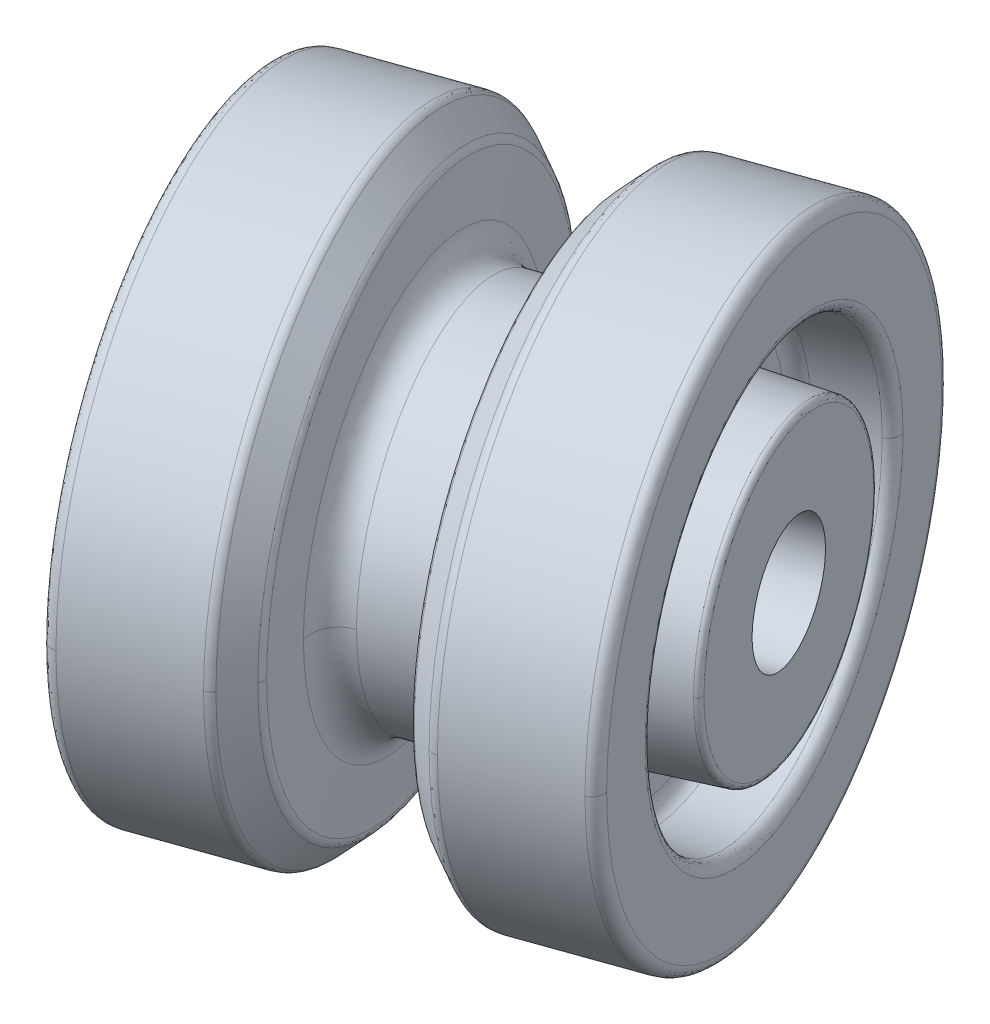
ISO-10303-21;
HEADER;
FILE_DESCRIPTION(('STEP AP214'),'2;1');
FILE_NAME('part.step','',(''),(''),'','','');
FILE_SCHEMA(('AUTOMOTIVE_DESIGN { 1 0 10303 214 1 1 1 1 }'));
ENDSEC;
DATA;
#1=APPLICATION_CONTEXT('core data for automotive mechanical design processes');
#2=APPLICATION_PROTOCOL_DEFINITION('international standard','automotive_design',2000,#1);
#3=PRODUCT_CONTEXT('',#1,'mechanical');
#4=PRODUCT('Part','Part','',(#3));
#5=PRODUCT_RELATED_PRODUCT_CATEGORY('part','',(#4));
#6=PRODUCT_DEFINITION_FORMATION('','',#4);
#7=PRODUCT_DEFINITION_CONTEXT('part definition',#1,'design');
#8=PRODUCT_DEFINITION('design','',#6,#7);
#9=PRODUCT_DEFINITION_SHAPE('','',#8);
#10=(LENGTH_UNIT() NAMED_UNIT(*) SI_UNIT(.MILLI.,.METRE.));
#11=(NAMED_UNIT(*) PLANE_ANGLE_UNIT() SI_UNIT($,.RADIAN.));
#12=(NAMED_UNIT(*) SI_UNIT($,.STERADIAN.) SOLID_ANGLE_UNIT());
#13=UNCERTAINTY_MEASURE_WITH_UNIT(LENGTH_MEASURE(1.E-05),#10,'distance_accuracy_value','');
#14=(GEOMETRIC_REPRESENTATION_CONTEXT(3) GLOBAL_UNCERTAINTY_ASSIGNED_CONTEXT((#13)) GLOBAL_UNIT_ASSIGNED_CONTEXT((#10,
#11,#12)) REPRESENTATION_CONTEXT('',''));
#15=CARTESIAN_POINT('',(0.,0.,0.));
#16=DIRECTION('',(0.,0.,1.));
#17=DIRECTION('',(1.,0.,0.));
#18=AXIS2_PLACEMENT_3D('',#15,#16,#17);
#19=CARTESIAN_POINT('',(6.07454196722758,-5.506360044,-28.4346009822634));
#20=DIRECTION('',(0.942641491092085,0.,-0.333806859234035));
#21=DIRECTION('',(-0.333806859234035,0.,-0.942641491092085));
#22=AXIS2_PLACEMENT_3D('',#19,#20,#21);
#23=CYLINDRICAL_SURFACE('',#22,1.05000000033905);
#24=CARTESIAN_POINT('',(13.6439531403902,-5.506360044,-31.115070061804));
#25=DIRECTION('',(0.942641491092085,0.,-0.333806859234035));
#26=DIRECTION('',(-0.333806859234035,0.,-0.942641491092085));
#27=AXIS2_PLACEMENT_3D('',#24,#25,#26);
#28=CIRCLE('',#27,1.05000000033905);
#29=CARTESIAN_POINT('',(13.2934559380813,-5.506360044,-32.1048436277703));
#30=VERTEX_POINT('',#29);
#31=EDGE_CURVE('E464',#30,#30,#28,.F.);
#32=ORIENTED_EDGE('',*,*,#31,.F.);
#33=EDGE_LOOP('',(#32));
#34=FACE_BOUND('',#33,.T.);
#35=CARTESIAN_POINT('',(10.7877494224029,-5.506360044,-30.1036352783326));
#36=DIRECTION('',(-0.942641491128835,0.,0.333806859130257));
#37=DIRECTION('',(0.333806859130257,0.,0.942641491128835));
#38=AXIS2_PLACEMENT_3D('',#35,#36,#37);
#39=CIRCLE('',#38,1.05000000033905);
#40=CARTESIAN_POINT('',(11.1382466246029,-5.506360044,-29.1138617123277));
#41=VERTEX_POINT('',#40);
#42=EDGE_CURVE('E308',#41,#41,#39,.T.);
#43=ORIENTED_EDGE('',*,*,#42,.T.);
#44=EDGE_LOOP('',(#43));
#45=FACE_BOUND('',#44,.T.);
#46=ADVANCED_FACE('F34',(#34,#45),#23,.F.);
#47=CARTESIAN_POINT('',(8.95316093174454,-5.506360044,-29.4539734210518));
#48=DIRECTION('',(-0.94264149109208,0.,0.333806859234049));
#49=DIRECTION('',(0.333806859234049,0.,0.94264149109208));
#50=AXIS2_PLACEMENT_3D('',#47,#48,#49);
#51=CONICAL_SURFACE('',#50,3.47383202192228,1.51843644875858);
#52=CARTESIAN_POINT('',(8.90625395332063,-5.506360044,-29.4373627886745));
#53=DIRECTION('',(-0.942641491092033,0.,0.333806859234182));
#54=DIRECTION('',(0.333806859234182,0.,0.942641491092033));
#55=AXIS2_PLACEMENT_3D('',#52,#53,#54);
#56=CIRCLE('',#55,4.42333240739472);
#57=CARTESIAN_POINT('',(7.42971525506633,-5.506360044,-33.60697944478));
#58=VERTEX_POINT('',#57);
#59=CARTESIAN_POINT('',(10.3827926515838,-5.50636004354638,-25.2677461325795));
#60=VERTEX_POINT('',#59);
#61=EDGE_CURVE('E251',#58,#60,#56,.T.);
#62=ORIENTED_EDGE('',*,*,#61,.F.);
#63=CARTESIAN_POINT('',(8.90625395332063,-5.506360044,-29.4373627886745));
#64=DIRECTION('',(-0.942641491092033,0.,0.333806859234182));
#65=DIRECTION('',(0.333806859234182,0.,0.942641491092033));
#66=AXIS2_PLACEMENT_3D('',#63,#64,#65);
#67=CIRCLE('',#66,4.42333240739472);
#68=EDGE_CURVE('E239',#60,#58,#67,.T.);
#69=ORIENTED_EDGE('',*,*,#68,.F.);
#70=EDGE_LOOP('',(#62,#69));
#71=FACE_BOUND('',#70,.T.);
#72=CARTESIAN_POINT('',(8.95316093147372,-5.506360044,-29.4539734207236));
#73=DIRECTION('',(-0.942641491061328,0.,0.333806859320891));
#74=DIRECTION('',(0.333806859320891,0.,0.942641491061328));
#75=AXIS2_PLACEMENT_3D('',#72,#73,#74);
#76=CIRCLE('',#75,3.47383202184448);
#77=CARTESIAN_POINT('',(7.79357197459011,-5.506360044,-32.7285516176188));
#78=VERTEX_POINT('',#77);
#79=CARTESIAN_POINT('',(10.1127498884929,-5.50636004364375,-26.1793952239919));
#80=VERTEX_POINT('',#79);
#81=EDGE_CURVE('E283',#78,#80,#76,.T.);
#82=ORIENTED_EDGE('',*,*,#81,.T.);
#83=CARTESIAN_POINT('',(8.95316093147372,-5.506360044,-29.4539734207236));
#84=DIRECTION('',(-0.942641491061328,0.,0.333806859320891));
#85=DIRECTION('',(0.333806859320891,0.,0.942641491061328));
#86=AXIS2_PLACEMENT_3D('',#83,#84,#85);
#87=CIRCLE('',#86,3.47383202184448);
#88=EDGE_CURVE('E294',#80,#78,#87,.T.);
#89=ORIENTED_EDGE('',*,*,#88,.T.);
#90=EDGE_LOOP('',(#82,#89));
#91=FACE_BOUND('',#90,.T.);
#92=ADVANCED_FACE('F252',(#71,#91),#51,.T.);
#93=CARTESIAN_POINT('',(7.776777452,-5.506360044,-32.775624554));
#94=CARTESIAN_POINT('',(7.776777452,1.54126206,-32.775624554));
#95=CARTESIAN_POINT('',(10.129322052,1.54126206,-26.132243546));
#96=CARTESIAN_POINT('',(10.129322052,-5.506360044,-26.132243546));
#97=CARTESIAN_POINT('',(7.871535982,-5.506360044,-32.461182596));
#98=CARTESIAN_POINT('',(7.871535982,0.885187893,-32.461182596));
#99=CARTESIAN_POINT('',(10.005078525,0.885187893,-26.436244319));
#100=CARTESIAN_POINT('',(10.005078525,-5.506360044,-26.436244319));
#101=CARTESIAN_POINT('',(8.171553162,-5.506360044,-32.327606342));
#102=CARTESIAN_POINT('',(8.171553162,0.433063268,-32.327606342));
#103=CARTESIAN_POINT('',(10.154173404,0.433063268,-26.728859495));
#104=CARTESIAN_POINT('',(10.154173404,-5.506360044,-26.728859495));
#105=CARTESIAN_POINT('',(8.468634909,-5.506360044,-32.467589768));
#106=CARTESIAN_POINT('',(8.468634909,0.498635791,-32.467589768));
#107=CARTESIAN_POINT('',(10.473143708,0.498635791,-26.807031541));
#108=CARTESIAN_POINT('',(10.473143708,-5.506360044,-26.807031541));
#109=(BOUNDED_SURFACE() B_SPLINE_SURFACE(3,3,((#93,#94,#95,#96),(#97,#98,#99,#100),(#101,#102,
#103,#104),(#105,#106,#107,#108)),.UNSPECIFIED.,.F.,.F.,.F.) B_SPLINE_SURFACE_WITH_KNOTS((4,4),
(4,4),(0.,1.),(0.,1.),
.UNSPECIFIED.) GEOMETRIC_REPRESENTATION_ITEM() RATIONAL_B_SPLINE_SURFACE(((1.,0.333333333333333,
0.333333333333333,1.),(0.768686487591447,0.256228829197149,0.256228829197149,0.768686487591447),
(0.768686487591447,0.256228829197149,0.256228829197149,0.768686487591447),(1.,0.333333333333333,
0.333333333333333,1.))) REPRESENTATION_ITEM('') SURFACE());
#110=CARTESIAN_POINT('',(9.42383574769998,-5.506360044,-29.6206481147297));
#111=DIRECTION('',(0.942641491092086,0.,-0.333806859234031));
#112=DIRECTION('',(-0.333806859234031,0.,-0.942641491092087));
#113=AXIS2_PLACEMENT_3D('',#110,#111,#112);
#114=CIRCLE('',#113,2.99999999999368);
#115=CARTESIAN_POINT('',(10.4252563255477,-5.50636004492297,-26.7927236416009));
#116=VERTEX_POINT('',#115);
#117=CARTESIAN_POINT('',(8.42241517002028,-5.50636004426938,-32.4485725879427));
#118=VERTEX_POINT('',#117);
#119=EDGE_CURVE('E269',#116,#118,#114,.F.);
#120=CARTESIAN_POINT('',(7.776777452,-5.506360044,-32.775624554));
#121=CARTESIAN_POINT('',(7.871535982,-5.506360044,-32.461182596));
#122=CARTESIAN_POINT('',(8.171553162,-5.506360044,-32.327606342));
#123=CARTESIAN_POINT('',(8.468634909,-5.506360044,-32.467589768));
#124=(BOUNDED_CURVE() B_SPLINE_CURVE(3,(#120,#121,#122,#123),.UNSPECIFIED.,.F.,
.F.) B_SPLINE_CURVE_WITH_KNOTS((4,4),(0.,1.),
.UNSPECIFIED.) CURVE() GEOMETRIC_REPRESENTATION_ITEM() RATIONAL_B_SPLINE_CURVE((1.,
0.768686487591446,0.768686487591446,1.)) REPRESENTATION_ITEM(''));
#125=EDGE_CURVE('E288',#118,#78,#124,.F.);
#126=CARTESIAN_POINT('',(10.129322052,-5.506360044,-26.132243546));
#127=CARTESIAN_POINT('',(10.005078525,-5.506360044,-26.436244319));
#128=CARTESIAN_POINT('',(10.154173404,-5.506360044,-26.728859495));
#129=CARTESIAN_POINT('',(10.473143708,-5.506360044,-26.807031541));
#130=(BOUNDED_CURVE() B_SPLINE_CURVE(3,(#126,#127,#128,#129),.UNSPECIFIED.,.F.,
.F.) B_SPLINE_CURVE_WITH_KNOTS((4,4),(0.,1.),
.UNSPECIFIED.) CURVE() GEOMETRIC_REPRESENTATION_ITEM() RATIONAL_B_SPLINE_CURVE((1.,
0.768686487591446,0.768686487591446,1.)) REPRESENTATION_ITEM(''));
#131=EDGE_CURVE('E249',#80,#116,#130,.T.);
#132=ORIENTED_EDGE('',*,*,#119,.T.);
#133=ORIENTED_EDGE('',*,*,#125,.T.);
#134=ORIENTED_EDGE('',*,*,#88,.F.);
#135=ORIENTED_EDGE('',*,*,#131,.T.);
#136=EDGE_LOOP('',(#132,#133,#134,#135));
#137=FACE_BOUND('',#136,.T.);
#138=ADVANCED_FACE('F494',(#137),#109,.F.);
#139=CARTESIAN_POINT('',(10.129322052,-5.506360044,-26.132243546));
#140=CARTESIAN_POINT('',(10.129322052,-12.553982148,-26.132243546));
#141=CARTESIAN_POINT('',(7.776777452,-12.553982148,-32.775624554));
#142=CARTESIAN_POINT('',(7.776777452,-5.506360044,-32.775624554));
#143=CARTESIAN_POINT('',(10.005078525,-5.506360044,-26.436244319));
#144=CARTESIAN_POINT('',(10.005078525,-11.897907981,-26.436244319));
#145=CARTESIAN_POINT('',(7.871535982,-11.897907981,-32.461182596));
#146=CARTESIAN_POINT('',(7.871535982,-5.506360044,-32.461182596));
#147=CARTESIAN_POINT('',(10.154173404,-5.506360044,-26.728859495));
#148=CARTESIAN_POINT('',(10.154173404,-11.445783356,-26.728859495));
#149=CARTESIAN_POINT('',(8.171553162,-11.445783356,-32.327606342));
#150=CARTESIAN_POINT('',(8.171553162,-5.506360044,-32.327606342));
#151=CARTESIAN_POINT('',(10.473143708,-5.506360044,-26.807031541));
#152=CARTESIAN_POINT('',(10.473143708,-11.511355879,-26.807031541));
#153=CARTESIAN_POINT('',(8.468634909,-11.511355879,-32.467589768));
#154=CARTESIAN_POINT('',(8.468634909,-5.506360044,-32.467589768));
#155=(BOUNDED_SURFACE() B_SPLINE_SURFACE(3,3,((#139,#140,#141,#142),(#143,#144,#145,#146),(#147,
#148,#149,#150),(#151,#152,#153,#154)),.UNSPECIFIED.,.F.,.F.,
.F.) B_SPLINE_SURFACE_WITH_KNOTS((4,4),(4,4),(0.,1.),(0.,1.),
.UNSPECIFIED.) GEOMETRIC_REPRESENTATION_ITEM() RATIONAL_B_SPLINE_SURFACE(((1.,0.333333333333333,
0.333333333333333,1.),(0.768686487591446,0.256228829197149,0.256228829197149,0.768686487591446),
(0.768686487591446,0.256228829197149,0.256228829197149,0.768686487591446),(1.,0.333333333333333,
0.333333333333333,1.))) REPRESENTATION_ITEM('') SURFACE());
#156=CARTESIAN_POINT('',(9.42383574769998,-5.506360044,-29.6206481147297));
#157=DIRECTION('',(0.942641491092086,0.,-0.333806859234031));
#158=DIRECTION('',(-0.333806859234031,0.,-0.942641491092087));
#159=AXIS2_PLACEMENT_3D('',#156,#157,#158);
#160=CIRCLE('',#159,2.99999999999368);
#161=EDGE_CURVE('E274',#118,#116,#160,.F.);
#162=ORIENTED_EDGE('',*,*,#131,.F.);
#163=ORIENTED_EDGE('',*,*,#81,.F.);
#164=ORIENTED_EDGE('',*,*,#125,.F.);
#165=ORIENTED_EDGE('',*,*,#161,.T.);
#166=EDGE_LOOP('',(#162,#163,#164,#165));
#167=FACE_BOUND('',#166,.T.);
#168=ADVANCED_FACE('F1165',(#167),#155,.F.);
#169=CARTESIAN_POINT('',(10.362048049,-5.506360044,-25.107249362));
#170=CARTESIAN_POINT('',(10.362048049,3.62903722,-25.107249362));
#171=CARTESIAN_POINT('',(7.312589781,3.62903722,-33.718653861));
#172=CARTESIAN_POINT('',(7.312589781,-5.506360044,-33.718653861));
#173=CARTESIAN_POINT('',(10.39552594,-5.506360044,-25.162463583));
#174=CARTESIAN_POINT('',(10.39552594,3.547293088,-25.162463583));
#175=CARTESIAN_POINT('',(7.373354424,3.547293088,-33.696812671));
#176=CARTESIAN_POINT('',(7.373354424,-5.506360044,-33.696812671));
#177=CARTESIAN_POINT('',(10.400592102,-5.506360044,-25.226835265));
#178=CARTESIAN_POINT('',(10.400592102,3.42931649,-25.226835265));
#179=CARTESIAN_POINT('',(7.417801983,3.42931649,-33.649974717));
#180=CARTESIAN_POINT('',(7.417801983,-5.506360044,-33.649974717));
#181=CARTESIAN_POINT('',(10.376163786,-5.506360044,-25.286606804));
#182=CARTESIAN_POINT('',(10.376163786,3.300321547,-25.286606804));
#183=CARTESIAN_POINT('',(7.436433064,3.300321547,-33.58815027));
#184=CARTESIAN_POINT('',(7.436433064,-5.506360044,-33.58815027));
#185=(BOUNDED_SURFACE() B_SPLINE_SURFACE(3,3,((#169,#170,#171,#172),(#173,#174,#175,#176),(#177,
#178,#179,#180),(#181,#182,#183,#184)),.UNSPECIFIED.,.F.,.F.,
.F.) B_SPLINE_SURFACE_WITH_KNOTS((4,4),(4,4),(0.,1.),(0.,1.),
.UNSPECIFIED.) GEOMETRIC_REPRESENTATION_ITEM() RATIONAL_B_SPLINE_SURFACE(((1.,0.333333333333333,
0.333333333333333,1.),(0.928759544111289,0.309586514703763,0.309586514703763,0.928759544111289),
(0.928759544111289,0.309586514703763,0.309586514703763,0.928759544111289),(1.,0.333333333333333,
0.333333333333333,1.))) REPRESENTATION_ITEM('') SURFACE());
#186=CARTESIAN_POINT('',(8.85129366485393,-5.506360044,-29.4179003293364));
#187=DIRECTION('',(-0.942641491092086,0.,0.333806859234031));
#188=DIRECTION('',(-0.33380685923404,0.,-0.942641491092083));
#189=AXIS2_PLACEMENT_3D('',#186,#187,#188);
#190=CIRCLE('',#189,4.55428657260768);
#191=CARTESIAN_POINT('',(7.33104156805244,-5.50636004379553,-33.7109598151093));
#192=VERTEX_POINT('',#191);
#193=CARTESIAN_POINT('',(10.3715457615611,-5.50636004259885,-25.1248408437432));
#194=VERTEX_POINT('',#193);
#195=EDGE_CURVE('E279',#192,#194,#190,.F.);
#196=CARTESIAN_POINT('',(10.362048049,-5.506360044,-25.107249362));
#197=CARTESIAN_POINT('',(10.39552594,-5.506360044,-25.162463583));
#198=CARTESIAN_POINT('',(10.400592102,-5.506360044,-25.226835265));
#199=CARTESIAN_POINT('',(10.376163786,-5.506360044,-25.286606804));
#200=(BOUNDED_CURVE() B_SPLINE_CURVE(3,(#196,#197,#198,#199),.UNSPECIFIED.,.F.,
.F.) B_SPLINE_CURVE_WITH_KNOTS((4,4),(0.,1.),
.UNSPECIFIED.) CURVE() GEOMETRIC_REPRESENTATION_ITEM() RATIONAL_B_SPLINE_CURVE((1.,
0.928759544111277,0.928759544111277,1.)) REPRESENTATION_ITEM(''));
#201=EDGE_CURVE('E246',#60,#194,#200,.F.);
#202=CARTESIAN_POINT('',(7.312589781,-5.506360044,-33.718653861));
#203=CARTESIAN_POINT('',(7.373354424,-5.506360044,-33.696812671));
#204=CARTESIAN_POINT('',(7.417801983,-5.506360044,-33.649974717));
#205=CARTESIAN_POINT('',(7.436433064,-5.506360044,-33.58815027));
#206=(BOUNDED_CURVE() B_SPLINE_CURVE(3,(#202,#203,#204,#205),.UNSPECIFIED.,.F.,
.F.) B_SPLINE_CURVE_WITH_KNOTS((4,4),(0.,1.),
.UNSPECIFIED.) CURVE() GEOMETRIC_REPRESENTATION_ITEM() RATIONAL_B_SPLINE_CURVE((1.,
0.928759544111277,0.928759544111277,1.)) REPRESENTATION_ITEM(''));
#207=EDGE_CURVE('E243',#192,#58,#206,.T.);
#208=ORIENTED_EDGE('',*,*,#195,.T.);
#209=ORIENTED_EDGE('',*,*,#201,.F.);
#210=ORIENTED_EDGE('',*,*,#68,.T.);
#211=ORIENTED_EDGE('',*,*,#207,.F.);
#212=EDGE_LOOP('',(#208,#209,#210,#211));
#213=FACE_BOUND('',#212,.T.);
#214=ADVANCED_FACE('F241',(#213),#185,.T.);
#215=CARTESIAN_POINT('',(7.312589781,-5.506360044,-33.718653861));
#216=CARTESIAN_POINT('',(7.312589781,-14.641757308,-33.718653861));
#217=CARTESIAN_POINT('',(10.362048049,-14.641757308,-25.107249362));
#218=CARTESIAN_POINT('',(10.362048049,-5.506360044,-25.107249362));
#219=CARTESIAN_POINT('',(7.373354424,-5.506360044,-33.696812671));
#220=CARTESIAN_POINT('',(7.373354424,-14.560013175,-33.696812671));
#221=CARTESIAN_POINT('',(10.39552594,-14.560013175,-25.162463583));
#222=CARTESIAN_POINT('',(10.39552594,-5.506360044,-25.162463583));
#223=CARTESIAN_POINT('',(7.417801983,-5.506360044,-33.649974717));
#224=CARTESIAN_POINT('',(7.417801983,-14.442036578,-33.649974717));
#225=CARTESIAN_POINT('',(10.400592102,-14.442036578,-25.226835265));
#226=CARTESIAN_POINT('',(10.400592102,-5.506360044,-25.226835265));
#227=CARTESIAN_POINT('',(7.436433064,-5.506360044,-33.58815027));
#228=CARTESIAN_POINT('',(7.436433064,-14.313041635,-33.58815027));
#229=CARTESIAN_POINT('',(10.376163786,-14.313041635,-25.286606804));
#230=CARTESIAN_POINT('',(10.376163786,-5.506360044,-25.286606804));
#231=(BOUNDED_SURFACE() B_SPLINE_SURFACE(3,3,((#215,#216,#217,#218),(#219,#220,#221,#222),(#223,
#224,#225,#226),(#227,#228,#229,#230)),.UNSPECIFIED.,.F.,.F.,
.F.) B_SPLINE_SURFACE_WITH_KNOTS((4,4),(4,4),(0.,1.),(0.,1.),
.UNSPECIFIED.) GEOMETRIC_REPRESENTATION_ITEM() RATIONAL_B_SPLINE_SURFACE(((1.,0.333333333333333,
0.333333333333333,1.),(0.928759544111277,0.309586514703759,0.309586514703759,0.928759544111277),
(0.928759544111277,0.309586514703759,0.309586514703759,0.928759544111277),(1.,0.333333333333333,
0.333333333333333,1.))) REPRESENTATION_ITEM('') SURFACE());
#232=CARTESIAN_POINT('',(8.85129366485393,-5.506360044,-29.4179003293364));
#233=DIRECTION('',(-0.942641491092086,0.,0.333806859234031));
#234=DIRECTION('',(-0.33380685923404,0.,-0.942641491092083));
#235=AXIS2_PLACEMENT_3D('',#232,#233,#234);
#236=CIRCLE('',#235,4.55428657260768);
#237=EDGE_CURVE('E259',#194,#192,#236,.F.);
#238=ORIENTED_EDGE('',*,*,#201,.T.);
#239=ORIENTED_EDGE('',*,*,#237,.T.);
#240=ORIENTED_EDGE('',*,*,#207,.T.);
#241=ORIENTED_EDGE('',*,*,#61,.T.);
#242=EDGE_LOOP('',(#238,#239,#240,#241));
#243=FACE_BOUND('',#242,.T.);
#244=ADVANCED_FACE('F257',(#243),#231,.T.);
#245=CARTESIAN_POINT('',(9.42383574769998,-5.506360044,-29.6206481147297));
#246=DIRECTION('',(0.942641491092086,0.,-0.333806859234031));
#247=DIRECTION('',(-0.333806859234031,0.,-0.942641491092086));
#248=AXIS2_PLACEMENT_3D('',#245,#246,#247);
#249=CYLINDRICAL_SURFACE('',#248,2.9999999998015);
#250=ORIENTED_EDGE('',*,*,#161,.F.);
#251=ORIENTED_EDGE('',*,*,#119,.F.);
#252=EDGE_LOOP('',(#250,#251));
#253=FACE_BOUND('',#252,.T.);
#254=CARTESIAN_POINT('',(10.2946593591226,-5.506360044,-29.9290229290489));
#255=DIRECTION('',(-0.942641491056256,0.,0.333806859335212));
#256=DIRECTION('',(0.333806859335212,0.,0.942641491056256));
#257=AXIS2_PLACEMENT_3D('',#254,#255,#256);
#258=CIRCLE('',#257,2.99999999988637);
#259=CARTESIAN_POINT('',(11.2960799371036,-5.50636004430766,-27.1010984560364));
#260=VERTEX_POINT('',#259);
#261=CARTESIAN_POINT('',(9.29323878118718,-5.50636004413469,-32.7569474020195));
#262=VERTEX_POINT('',#261);
#263=EDGE_CURVE('E1100',#260,#262,#258,.T.);
#264=ORIENTED_EDGE('',*,*,#263,.T.);
#265=CARTESIAN_POINT('',(10.2946593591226,-5.506360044,-29.9290229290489));
#266=DIRECTION('',(-0.942641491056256,0.,0.333806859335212));
#267=DIRECTION('',(0.333806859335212,0.,0.942641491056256));
#268=AXIS2_PLACEMENT_3D('',#265,#266,#267);
#269=CIRCLE('',#268,2.99999999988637);
#270=EDGE_CURVE('E1089',#262,#260,#269,.T.);
#271=ORIENTED_EDGE('',*,*,#270,.T.);
#272=EDGE_LOOP('',(#264,#271));
#273=FACE_BOUND('',#272,.T.);
#274=ADVANCED_FACE('F1135',(#253,#273),#249,.T.);
#275=CARTESIAN_POINT('',(8.85129366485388,-5.506360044,-29.4179003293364));
#276=DIRECTION('',(-0.942641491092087,0.,0.333806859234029));
#277=DIRECTION('',(0.333806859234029,0.,0.942641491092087));
#278=AXIS2_PLACEMENT_3D('',#275,#276,#277);
#279=CONICAL_SURFACE('',#278,4.55428657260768,0.78539816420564);
#280=CARTESIAN_POINT('',(8.48636435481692,-5.506360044,-29.2886720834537));
#281=DIRECTION('',(-0.942641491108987,0.,0.333806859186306));
#282=DIRECTION('',(0.333806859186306,0.,0.942641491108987));
#283=AXIS2_PLACEMENT_3D('',#280,#281,#282);
#284=CIRCLE('',#283,4.94142135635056);
#285=CARTESIAN_POINT('',(6.8368840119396,-5.506360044,-33.9466608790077));
#286=VERTEX_POINT('',#285);
#287=CARTESIAN_POINT('',(10.1358446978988,-5.50636004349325,-24.6306832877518));
#288=VERTEX_POINT('',#287);
#289=EDGE_CURVE('E1057',#286,#288,#284,.T.);
#290=ORIENTED_EDGE('',*,*,#289,.F.);
#291=CARTESIAN_POINT('',(8.48636435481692,-5.506360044,-29.2886720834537));
#292=DIRECTION('',(-0.942641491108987,0.,0.333806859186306));
#293=DIRECTION('',(0.333806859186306,0.,0.942641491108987));
#294=AXIS2_PLACEMENT_3D('',#291,#292,#293);
#295=CIRCLE('',#294,4.94142135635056);
#296=EDGE_CURVE('E1072',#288,#286,#295,.T.);
#297=ORIENTED_EDGE('',*,*,#296,.F.);
#298=EDGE_LOOP('',(#290,#297));
#299=FACE_BOUND('',#298,.T.);
#300=ORIENTED_EDGE('',*,*,#237,.F.);
#301=ORIENTED_EDGE('',*,*,#195,.F.);
#302=EDGE_LOOP('',(#300,#301));
#303=FACE_BOUND('',#302,.T.);
#304=ADVANCED_FACE('F1132',(#299,#303),#279,.T.);
#305=CARTESIAN_POINT('',(9.245351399,-5.506360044,-32.742639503));
#306=CARTESIAN_POINT('',(9.245351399,0.498635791,-32.742639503));
#307=CARTESIAN_POINT('',(11.249860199,0.498635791,-27.082081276));
#308=CARTESIAN_POINT('',(11.249860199,-5.506360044,-27.082081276));
#309=CARTESIAN_POINT('',(9.564321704,-5.506360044,-32.82081155));
#310=CARTESIAN_POINT('',(9.564321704,0.433063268,-32.82081155));
#311=CARTESIAN_POINT('',(11.546941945,0.433063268,-27.222064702));
#312=CARTESIAN_POINT('',(11.546941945,-5.506360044,-27.222064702));
#313=CARTESIAN_POINT('',(9.713416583,-5.506360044,-33.113426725));
#314=CARTESIAN_POINT('',(9.713416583,0.885187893,-33.113426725));
#315=CARTESIAN_POINT('',(11.846959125,0.885187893,-27.088488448));
#316=CARTESIAN_POINT('',(11.846959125,-5.506360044,-27.088488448));
#317=CARTESIAN_POINT('',(9.589173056,-5.506360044,-33.417427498));
#318=CARTESIAN_POINT('',(9.589173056,1.54126206,-33.417427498));
#319=CARTESIAN_POINT('',(11.941717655,1.54126206,-26.77404649));
#320=CARTESIAN_POINT('',(11.941717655,-5.506360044,-26.77404649));
#321=(BOUNDED_SURFACE() B_SPLINE_SURFACE(3,3,((#305,#306,#307,#308),(#309,#310,#311,#312),(#313,
#314,#315,#316),(#317,#318,#319,#320)),.UNSPECIFIED.,.F.,.F.,
.F.) B_SPLINE_SURFACE_WITH_KNOTS((4,4),(4,4),(0.,1.),(0.,1.),
.UNSPECIFIED.) GEOMETRIC_REPRESENTATION_ITEM() RATIONAL_B_SPLINE_SURFACE(((1.,0.333333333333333,
0.333333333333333,1.),(0.768686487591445,0.256228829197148,0.256228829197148,0.768686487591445),
(0.768686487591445,0.256228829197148,0.256228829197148,0.768686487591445),(1.,0.333333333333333,
0.333333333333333,1.))) REPRESENTATION_ITEM('') SURFACE());
#322=CARTESIAN_POINT('',(10.7653341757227,-5.506360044,-30.0956976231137));
#323=DIRECTION('',(0.942641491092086,0.,-0.333806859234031));
#324=DIRECTION('',(-0.333806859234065,0.,-0.942641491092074));
#325=AXIS2_PLACEMENT_3D('',#322,#323,#324);
#326=CIRCLE('',#325,3.4738320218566);
#327=CARTESIAN_POINT('',(11.924923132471,-5.50636004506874,-26.8211194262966));
#328=VERTEX_POINT('',#327);
#329=CARTESIAN_POINT('',(9.60574521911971,-5.50636004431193,-33.3702758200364));
#330=VERTEX_POINT('',#329);
#331=EDGE_CURVE('E1056',#328,#330,#326,.F.);
#332=CARTESIAN_POINT('',(9.245351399,-5.506360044,-32.742639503));
#333=CARTESIAN_POINT('',(9.564321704,-5.506360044,-32.82081155));
#334=CARTESIAN_POINT('',(9.713416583,-5.506360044,-33.113426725));
#335=CARTESIAN_POINT('',(9.589173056,-5.506360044,-33.417427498));
#336=(BOUNDED_CURVE() B_SPLINE_CURVE(3,(#332,#333,#334,#335),.UNSPECIFIED.,.F.,
.F.) B_SPLINE_CURVE_WITH_KNOTS((4,4),(0.,1.),
.UNSPECIFIED.) CURVE() GEOMETRIC_REPRESENTATION_ITEM() RATIONAL_B_SPLINE_CURVE((1.,
0.768686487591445,0.768686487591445,1.)) REPRESENTATION_ITEM(''));
#337=EDGE_CURVE('E1094',#330,#262,#336,.F.);
#338=CARTESIAN_POINT('',(11.249860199,-5.506360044,-27.082081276));
#339=CARTESIAN_POINT('',(11.546941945,-5.506360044,-27.222064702));
#340=CARTESIAN_POINT('',(11.846959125,-5.506360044,-27.088488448));
#341=CARTESIAN_POINT('',(11.941717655,-5.506360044,-26.77404649));
#342=(BOUNDED_CURVE() B_SPLINE_CURVE(3,(#338,#339,#340,#341),.UNSPECIFIED.,.F.,
.F.) B_SPLINE_CURVE_WITH_KNOTS((4,4),(0.,1.),
.UNSPECIFIED.) CURVE() GEOMETRIC_REPRESENTATION_ITEM() RATIONAL_B_SPLINE_CURVE((1.,
0.768686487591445,0.768686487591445,1.)) REPRESENTATION_ITEM(''));
#343=EDGE_CURVE('E1087',#260,#328,#342,.T.);
#344=ORIENTED_EDGE('',*,*,#331,.T.);
#345=ORIENTED_EDGE('',*,*,#337,.T.);
#346=ORIENTED_EDGE('',*,*,#263,.F.);
#347=ORIENTED_EDGE('',*,*,#343,.T.);
#348=EDGE_LOOP('',(#344,#345,#346,#347));
#349=FACE_BOUND('',#348,.T.);
#350=ADVANCED_FACE('F1134',(#349),#321,.F.);
#351=CARTESIAN_POINT('',(11.249860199,-5.506360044,-27.082081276));
#352=CARTESIAN_POINT('',(11.249860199,-11.511355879,-27.082081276));
#353=CARTESIAN_POINT('',(9.245351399,-11.511355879,-32.742639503));
#354=CARTESIAN_POINT('',(9.245351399,-5.506360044,-32.742639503));
#355=CARTESIAN_POINT('',(11.546941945,-5.506360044,-27.222064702));
#356=CARTESIAN_POINT('',(11.546941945,-11.445783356,-27.222064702));
#357=CARTESIAN_POINT('',(9.564321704,-11.445783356,-32.82081155));
#358=CARTESIAN_POINT('',(9.564321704,-5.506360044,-32.82081155));
#359=CARTESIAN_POINT('',(11.846959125,-5.506360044,-27.088488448));
#360=CARTESIAN_POINT('',(11.846959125,-11.897907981,-27.088488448));
#361=CARTESIAN_POINT('',(9.713416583,-11.897907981,-33.113426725));
#362=CARTESIAN_POINT('',(9.713416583,-5.506360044,-33.113426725));
#363=CARTESIAN_POINT('',(11.941717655,-5.506360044,-26.77404649));
#364=CARTESIAN_POINT('',(11.941717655,-12.553982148,-26.77404649));
#365=CARTESIAN_POINT('',(9.589173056,-12.553982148,-33.417427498));
#366=CARTESIAN_POINT('',(9.589173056,-5.506360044,-33.417427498));
#367=(BOUNDED_SURFACE() B_SPLINE_SURFACE(3,3,((#351,#352,#353,#354),(#355,#356,#357,#358),(#359,
#360,#361,#362),(#363,#364,#365,#366)),.UNSPECIFIED.,.F.,.F.,
.F.) B_SPLINE_SURFACE_WITH_KNOTS((4,4),(4,4),(0.,1.),(0.,1.),
.UNSPECIFIED.) GEOMETRIC_REPRESENTATION_ITEM() RATIONAL_B_SPLINE_SURFACE(((1.,0.333333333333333,
0.333333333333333,1.),(0.768686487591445,0.256228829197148,0.256228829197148,0.768686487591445),
(0.768686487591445,0.256228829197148,0.256228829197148,0.768686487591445),(1.,0.333333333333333,
0.333333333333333,1.))) REPRESENTATION_ITEM('') SURFACE());
#368=CARTESIAN_POINT('',(10.7653341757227,-5.506360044,-30.0956976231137));
#369=DIRECTION('',(0.942641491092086,0.,-0.333806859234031));
#370=DIRECTION('',(-0.333806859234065,0.,-0.942641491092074));
#371=AXIS2_PLACEMENT_3D('',#368,#369,#370);
#372=CIRCLE('',#371,3.4738320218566);
#373=EDGE_CURVE('E1050',#330,#328,#372,.F.);
#374=ORIENTED_EDGE('',*,*,#343,.F.);
#375=ORIENTED_EDGE('',*,*,#270,.F.);
#376=ORIENTED_EDGE('',*,*,#337,.F.);
#377=ORIENTED_EDGE('',*,*,#373,.T.);
#378=EDGE_LOOP('',(#374,#375,#376,#377));
#379=FACE_BOUND('',#378,.T.);
#380=ADVANCED_FACE('F1142',(#379),#367,.F.);
#381=CARTESIAN_POINT('',(10.00293406,-5.506360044,-24.52253405));
#382=CARTESIAN_POINT('',(10.00293406,4.491641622,-24.52253405));
#383=CARTESIAN_POINT('',(6.665532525,4.491641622,-33.947065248));
#384=CARTESIAN_POINT('',(6.665532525,-5.506360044,-33.947065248));
#385=CARTESIAN_POINT('',(10.069464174,-5.506360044,-24.538839));
#386=CARTESIAN_POINT('',(10.069464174,4.505318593,-24.538839));
#387=CARTESIAN_POINT('',(6.727497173,4.505318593,-33.976262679));
#388=CARTESIAN_POINT('',(6.727497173,-5.506360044,-33.976262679));
#389=CARTESIAN_POINT('',(10.120368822,-5.506360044,-24.584673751));
#390=CARTESIAN_POINT('',(10.120368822,4.452891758,-24.584673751));
#391=CARTESIAN_POINT('',(6.795902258,4.452891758,-33.97267772));
#392=CARTESIAN_POINT('',(6.795902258,-5.506360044,-33.97267772));
#393=CARTESIAN_POINT('',(10.143538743,-5.506360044,-24.649135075));
#394=CARTESIAN_POINT('',(10.143538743,4.346832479,-24.649135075));
#395=CARTESIAN_POINT('',(6.854475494,4.346832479,-33.937163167));
#396=CARTESIAN_POINT('',(6.854475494,-5.506360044,-33.937163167));
#397=(BOUNDED_SURFACE() B_SPLINE_SURFACE(3,3,((#381,#382,#383,#384),(#385,#386,#387,#388),(#389,
#390,#391,#392),(#393,#394,#395,#396)),.UNSPECIFIED.,.F.,.F.,
.F.) B_SPLINE_SURFACE_WITH_KNOTS((4,4),(4,4),(0.,1.),(0.,1.),
.UNSPECIFIED.) GEOMETRIC_REPRESENTATION_ITEM() RATIONAL_B_SPLINE_SURFACE(((1.,0.333333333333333,
0.333333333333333,1.),(0.920706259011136,0.306902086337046,0.306902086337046,0.920706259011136),
(0.920706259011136,0.306902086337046,0.306902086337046,0.920706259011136),(1.,0.333333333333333,
0.333333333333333,1.))) REPRESENTATION_ITEM('') SURFACE());
#398=CARTESIAN_POINT('',(8.35305471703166,-5.506360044,-29.2414646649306));
#399=DIRECTION('',(-0.942641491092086,0.,0.333806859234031));
#400=DIRECTION('',(-0.333806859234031,0.,-0.942641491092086));
#401=AXIS2_PLACEMENT_3D('',#398,#399,#400);
#402=CIRCLE('',#401,4.99999999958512);
#403=CARTESIAN_POINT('',(6.68402042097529,-5.50636004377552,-33.954672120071));
#404=VERTEX_POINT('',#403);
#405=CARTESIAN_POINT('',(10.022089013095,-5.50636004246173,-24.5282572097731));
#406=VERTEX_POINT('',#405);
#407=EDGE_CURVE('E1048',#404,#406,#402,.F.);
#408=CARTESIAN_POINT('',(10.00293406,-5.506360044,-24.52253405));
#409=CARTESIAN_POINT('',(10.069464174,-5.506360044,-24.538839));
#410=CARTESIAN_POINT('',(10.120368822,-5.506360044,-24.584673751));
#411=CARTESIAN_POINT('',(10.143538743,-5.506360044,-24.649135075));
#412=(BOUNDED_CURVE() B_SPLINE_CURVE(3,(#408,#409,#410,#411),.UNSPECIFIED.,.F.,
.F.) B_SPLINE_CURVE_WITH_KNOTS((4,4),(0.,1.),
.UNSPECIFIED.) CURVE() GEOMETRIC_REPRESENTATION_ITEM() RATIONAL_B_SPLINE_CURVE((1.,
0.920706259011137,0.920706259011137,1.)) REPRESENTATION_ITEM(''));
#413=EDGE_CURVE('E1053',#288,#406,#412,.F.);
#414=CARTESIAN_POINT('',(6.665532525,-5.506360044,-33.947065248));
#415=CARTESIAN_POINT('',(6.727497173,-5.506360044,-33.976262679));
#416=CARTESIAN_POINT('',(6.795902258,-5.506360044,-33.97267772));
#417=CARTESIAN_POINT('',(6.854475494,-5.506360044,-33.937163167));
#418=(BOUNDED_CURVE() B_SPLINE_CURVE(3,(#414,#415,#416,#417),.UNSPECIFIED.,.F.,
.F.) B_SPLINE_CURVE_WITH_KNOTS((4,4),(0.,1.),
.UNSPECIFIED.) CURVE() GEOMETRIC_REPRESENTATION_ITEM() RATIONAL_B_SPLINE_CURVE((1.,
0.920706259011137,0.920706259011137,1.)) REPRESENTATION_ITEM(''));
#419=EDGE_CURVE('E1069',#404,#286,#418,.T.);
#420=ORIENTED_EDGE('',*,*,#407,.T.);
#421=ORIENTED_EDGE('',*,*,#413,.F.);
#422=ORIENTED_EDGE('',*,*,#296,.T.);
#423=ORIENTED_EDGE('',*,*,#419,.F.);
#424=EDGE_LOOP('',(#420,#421,#422,#423));
#425=FACE_BOUND('',#424,.T.);
#426=ADVANCED_FACE('F1516',(#425),#397,.T.);
#427=CARTESIAN_POINT('',(6.665532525,-5.506360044,-33.947065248));
#428=CARTESIAN_POINT('',(6.665532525,-15.50436171,-33.947065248));
#429=CARTESIAN_POINT('',(10.00293406,-15.50436171,-24.52253405));
#430=CARTESIAN_POINT('',(10.00293406,-5.506360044,-24.52253405));
#431=CARTESIAN_POINT('',(6.727497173,-5.506360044,-33.976262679));
#432=CARTESIAN_POINT('',(6.727497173,-15.51803868,-33.976262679));
#433=CARTESIAN_POINT('',(10.069464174,-15.51803868,-24.538839));
#434=CARTESIAN_POINT('',(10.069464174,-5.506360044,-24.538839));
#435=CARTESIAN_POINT('',(6.795902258,-5.506360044,-33.97267772));
#436=CARTESIAN_POINT('',(6.795902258,-15.465611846,-33.97267772));
#437=CARTESIAN_POINT('',(10.120368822,-15.465611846,-24.584673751));
#438=CARTESIAN_POINT('',(10.120368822,-5.506360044,-24.584673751));
#439=CARTESIAN_POINT('',(6.854475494,-5.506360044,-33.937163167));
#440=CARTESIAN_POINT('',(6.854475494,-15.359552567,-33.937163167));
#441=CARTESIAN_POINT('',(10.143538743,-15.359552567,-24.649135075));
#442=CARTESIAN_POINT('',(10.143538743,-5.506360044,-24.649135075));
#443=(BOUNDED_SURFACE() B_SPLINE_SURFACE(3,3,((#427,#428,#429,#430),(#431,#432,#433,#434),(#435,
#436,#437,#438),(#439,#440,#441,#442)),.UNSPECIFIED.,.F.,.F.,
.F.) B_SPLINE_SURFACE_WITH_KNOTS((4,4),(4,4),(0.,1.),(0.,1.),
.UNSPECIFIED.) GEOMETRIC_REPRESENTATION_ITEM() RATIONAL_B_SPLINE_SURFACE(((1.,0.333333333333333,
0.333333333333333,1.),(0.920706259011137,0.306902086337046,0.306902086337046,0.920706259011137),
(0.920706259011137,0.306902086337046,0.306902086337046,0.920706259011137),(1.,0.333333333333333,
0.333333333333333,1.))) REPRESENTATION_ITEM('') SURFACE());
#444=CARTESIAN_POINT('',(8.35305471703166,-5.506360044,-29.2414646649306));
#445=DIRECTION('',(-0.942641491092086,0.,0.333806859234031));
#446=DIRECTION('',(-0.333806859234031,0.,-0.942641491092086));
#447=AXIS2_PLACEMENT_3D('',#444,#445,#446);
#448=CIRCLE('',#447,4.99999999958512);
#449=EDGE_CURVE('E1041',#406,#404,#448,.F.);
#450=ORIENTED_EDGE('',*,*,#413,.T.);
#451=ORIENTED_EDGE('',*,*,#449,.T.);
#452=ORIENTED_EDGE('',*,*,#419,.T.);
#453=ORIENTED_EDGE('',*,*,#289,.T.);
#454=EDGE_LOOP('',(#450,#451,#452,#453));
#455=FACE_BOUND('',#454,.T.);
#456=ADVANCED_FACE('F1210',(#455),#443,.T.);
#457=CARTESIAN_POINT('',(10.7653341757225,-5.506360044,-30.0956976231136));
#458=DIRECTION('',(0.942641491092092,0.,-0.333806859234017));
#459=DIRECTION('',(-0.333806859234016,0.,-0.942641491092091));
#460=AXIS2_PLACEMENT_3D('',#457,#458,#459);
#461=CONICAL_SURFACE('',#460,3.47383202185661,1.51843644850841);
#462=ORIENTED_EDGE('',*,*,#373,.F.);
#463=ORIENTED_EDGE('',*,*,#331,.F.);
#464=EDGE_LOOP('',(#462,#463));
#465=FACE_BOUND('',#464,.T.);
#466=CARTESIAN_POINT('',(10.8122411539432,-5.506360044,-30.1123082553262));
#467=DIRECTION('',(0.942641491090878,0.,-0.333806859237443));
#468=DIRECTION('',(-0.333806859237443,0.,-0.942641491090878));
#469=AXIS2_PLACEMENT_3D('',#466,#467,#468);
#470=CIRCLE('',#469,4.42333240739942);
#471=CARTESIAN_POINT('',(9.33570245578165,-5.50636004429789,-34.2819249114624));
#472=VERTEX_POINT('',#471);
#473=CARTESIAN_POINT('',(12.2887798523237,-5.50636004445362,-25.9426915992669));
#474=VERTEX_POINT('',#473);
#475=EDGE_CURVE('E1022',#472,#474,#470,.T.);
#476=ORIENTED_EDGE('',*,*,#475,.F.);
#477=CARTESIAN_POINT('',(10.8122411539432,-5.506360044,-30.1123082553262));
#478=DIRECTION('',(0.942641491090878,0.,-0.333806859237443));
#479=DIRECTION('',(-0.333806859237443,0.,-0.942641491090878));
#480=AXIS2_PLACEMENT_3D('',#477,#478,#479);
#481=CIRCLE('',#480,4.42333240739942);
#482=EDGE_CURVE('E1011',#474,#472,#481,.T.);
#483=ORIENTED_EDGE('',*,*,#482,.F.);
#484=EDGE_LOOP('',(#476,#483));
#485=FACE_BOUND('',#484,.T.);
#486=ADVANCED_FACE('F1206',(#465,#485),#461,.T.);
#487=CARTESIAN_POINT('',(8.35305471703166,-5.506360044,-29.2414646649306));
#488=DIRECTION('',(-0.942641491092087,0.,0.333806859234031));
#489=DIRECTION('',(0.333806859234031,0.,0.942641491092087));
#490=AXIS2_PLACEMENT_3D('',#487,#488,#489);
#491=CYLINDRICAL_SURFACE('',#490,4.99999999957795);
#492=CARTESIAN_POINT('',(6.45159856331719,-5.506360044,-28.5681237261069));
#493=DIRECTION('',(-0.942641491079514,0.,0.333806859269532));
#494=DIRECTION('',(0.333806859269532,0.,0.942641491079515));
#495=AXIS2_PLACEMENT_3D('',#492,#493,#494);
#496=CIRCLE('',#495,4.99999999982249);
#497=CARTESIAN_POINT('',(4.7825642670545,-5.506360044,-33.2813311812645));
#498=VERTEX_POINT('',#497);
#499=CARTESIAN_POINT('',(8.12063285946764,-5.50636004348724,-23.8549162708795));
#500=VERTEX_POINT('',#499);
#501=EDGE_CURVE('E1035',#498,#500,#496,.T.);
#502=ORIENTED_EDGE('',*,*,#501,.F.);
#503=CARTESIAN_POINT('',(6.45159856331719,-5.506360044,-28.5681237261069));
#504=DIRECTION('',(-0.942641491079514,0.,0.333806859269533));
#505=DIRECTION('',(0.333806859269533,0.,0.942641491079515));
#506=AXIS2_PLACEMENT_3D('',#503,#504,#505);
#507=CIRCLE('',#506,4.99999999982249);
#508=EDGE_CURVE('E1027',#500,#498,#507,.T.);
#509=ORIENTED_EDGE('',*,*,#508,.F.);
#510=EDGE_LOOP('',(#502,#509));
#511=FACE_BOUND('',#510,.T.);
#512=ORIENTED_EDGE('',*,*,#449,.F.);
#513=ORIENTED_EDGE('',*,*,#407,.F.);
#514=EDGE_LOOP('',(#512,#513));
#515=FACE_BOUND('',#514,.T.);
#516=ADVANCED_FACE('F1209',(#511,#515),#491,.T.);
#517=CARTESIAN_POINT('',(12.282062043,-5.506360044,-25.961520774));
#518=CARTESIAN_POINT('',(12.282062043,3.300321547,-25.961520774));
#519=CARTESIAN_POINT('',(9.342331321,3.300321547,-34.26306424));
#520=CARTESIAN_POINT('',(9.342331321,-5.506360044,-34.26306424));
#521=CARTESIAN_POINT('',(12.300693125,-5.506360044,-25.899696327));
#522=CARTESIAN_POINT('',(12.300693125,3.42931649,-25.899696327));
#523=CARTESIAN_POINT('',(9.317903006,3.42931649,-34.322835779));
#524=CARTESIAN_POINT('',(9.317903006,-5.506360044,-34.322835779));
#525=CARTESIAN_POINT('',(12.345140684,-5.506360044,-25.852858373));
#526=CARTESIAN_POINT('',(12.345140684,3.547293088,-25.852858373));
#527=CARTESIAN_POINT('',(9.322969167,3.547293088,-34.387207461));
#528=CARTESIAN_POINT('',(9.322969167,-5.506360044,-34.387207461));
#529=CARTESIAN_POINT('',(12.405905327,-5.506360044,-25.831017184));
#530=CARTESIAN_POINT('',(12.405905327,3.62903722,-25.831017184));
#531=CARTESIAN_POINT('',(9.356447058,3.62903722,-34.442421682));
#532=CARTESIAN_POINT('',(9.356447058,-5.506360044,-34.442421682));
#533=(BOUNDED_SURFACE() B_SPLINE_SURFACE(3,3,((#517,#518,#519,#520),(#521,#522,#523,#524),(#525,
#526,#527,#528),(#529,#530,#531,#532)),.UNSPECIFIED.,.F.,.F.,
.F.) B_SPLINE_SURFACE_WITH_KNOTS((4,4),(4,4),(0.,1.),(0.,1.),
.UNSPECIFIED.) GEOMETRIC_REPRESENTATION_ITEM() RATIONAL_B_SPLINE_SURFACE(((1.,0.333333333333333,
0.333333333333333,1.),(0.92875954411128,0.30958651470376,0.30958651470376,0.92875954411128),
(0.92875954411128,0.30958651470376,0.30958651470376,0.92875954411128),(1.,0.333333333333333,
0.333333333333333,1.))) REPRESENTATION_ITEM('') SURFACE());
#534=CARTESIAN_POINT('',(12.282062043,-5.506360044,-25.961520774));
#535=CARTESIAN_POINT('',(12.300693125,-5.506360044,-25.899696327));
#536=CARTESIAN_POINT('',(12.345140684,-5.506360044,-25.852858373));
#537=CARTESIAN_POINT('',(12.405905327,-5.506360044,-25.831017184));
#538=(BOUNDED_CURVE() B_SPLINE_CURVE(3,(#534,#535,#536,#537),.UNSPECIFIED.,.F.,
.F.) B_SPLINE_CURVE_WITH_KNOTS((4,4),(0.,1.),
.UNSPECIFIED.) CURVE() GEOMETRIC_REPRESENTATION_ITEM() RATIONAL_B_SPLINE_CURVE((1.,
0.928759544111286,0.928759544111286,1.)) REPRESENTATION_ITEM(''));
#539=CARTESIAN_POINT('',(12.3874535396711,-5.50636004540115,-25.8387112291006));
#540=VERTEX_POINT('',#539);
#541=EDGE_CURVE('E1008',#540,#474,#538,.F.);
#542=CARTESIAN_POINT('',(10.8672014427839,-5.506360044,-30.1317707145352));
#543=DIRECTION('',(0.942641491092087,0.,-0.333806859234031));
#544=DIRECTION('',(-0.333806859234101,0.,-0.942641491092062));
#545=AXIS2_PLACEMENT_3D('',#542,#543,#544);
#546=CIRCLE('',#545,4.55428657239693);
#547=CARTESIAN_POINT('',(9.34694934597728,-5.50636004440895,-34.4248302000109));
#548=VERTEX_POINT('',#547);
#549=EDGE_CURVE('E993',#540,#548,#546,.F.);
#550=CARTESIAN_POINT('',(9.342331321,-5.506360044,-34.26306424));
#551=CARTESIAN_POINT('',(9.317903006,-5.506360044,-34.322835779));
#552=CARTESIAN_POINT('',(9.322969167,-5.506360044,-34.387207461));
#553=CARTESIAN_POINT('',(9.356447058,-5.506360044,-34.442421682));
#554=(BOUNDED_CURVE() B_SPLINE_CURVE(3,(#550,#551,#552,#553),.UNSPECIFIED.,.F.,
.F.) B_SPLINE_CURVE_WITH_KNOTS((4,4),(0.,1.),
.UNSPECIFIED.) CURVE() GEOMETRIC_REPRESENTATION_ITEM() RATIONAL_B_SPLINE_CURVE((1.,
0.928759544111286,0.928759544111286,1.)) REPRESENTATION_ITEM(''));
#555=EDGE_CURVE('E1012',#472,#548,#554,.T.);
#556=ORIENTED_EDGE('',*,*,#475,.T.);
#557=ORIENTED_EDGE('',*,*,#541,.F.);
#558=ORIENTED_EDGE('',*,*,#549,.T.);
#559=ORIENTED_EDGE('',*,*,#555,.F.);
#560=EDGE_LOOP('',(#556,#557,#558,#559));
#561=FACE_BOUND('',#560,.T.);
#562=ADVANCED_FACE('F1215',(#561),#533,.T.);
#563=CARTESIAN_POINT('',(9.342331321,-5.506360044,-34.26306424));
#564=CARTESIAN_POINT('',(9.342331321,-14.313041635,-34.26306424));
#565=CARTESIAN_POINT('',(12.282062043,-14.313041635,-25.961520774));
#566=CARTESIAN_POINT('',(12.282062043,-5.506360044,-25.961520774));
#567=CARTESIAN_POINT('',(9.317903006,-5.506360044,-34.322835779));
#568=CARTESIAN_POINT('',(9.317903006,-14.442036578,-34.322835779));
#569=CARTESIAN_POINT('',(12.300693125,-14.442036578,-25.899696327));
#570=CARTESIAN_POINT('',(12.300693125,-5.506360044,-25.899696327));
#571=CARTESIAN_POINT('',(9.322969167,-5.506360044,-34.387207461));
#572=CARTESIAN_POINT('',(9.322969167,-14.560013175,-34.387207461));
#573=CARTESIAN_POINT('',(12.345140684,-14.560013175,-25.852858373));
#574=CARTESIAN_POINT('',(12.345140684,-5.506360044,-25.852858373));
#575=CARTESIAN_POINT('',(9.356447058,-5.506360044,-34.442421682));
#576=CARTESIAN_POINT('',(9.356447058,-14.641757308,-34.442421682));
#577=CARTESIAN_POINT('',(12.405905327,-14.641757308,-25.831017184));
#578=CARTESIAN_POINT('',(12.405905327,-5.506360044,-25.831017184));
#579=(BOUNDED_SURFACE() B_SPLINE_SURFACE(3,3,((#563,#564,#565,#566),(#567,#568,#569,#570),(#571,
#572,#573,#574),(#575,#576,#577,#578)),.UNSPECIFIED.,.F.,.F.,
.F.) B_SPLINE_SURFACE_WITH_KNOTS((4,4),(4,4),(0.,1.),(0.,1.),
.UNSPECIFIED.) GEOMETRIC_REPRESENTATION_ITEM() RATIONAL_B_SPLINE_SURFACE(((1.,0.333333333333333,
0.333333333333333,1.),(0.928759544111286,0.309586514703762,0.309586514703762,0.928759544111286),
(0.928759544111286,0.309586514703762,0.309586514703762,0.928759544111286),(1.,0.333333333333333,
0.333333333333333,1.))) REPRESENTATION_ITEM('') SURFACE());
#580=CARTESIAN_POINT('',(10.8672014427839,-5.506360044,-30.1317707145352));
#581=DIRECTION('',(0.942641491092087,0.,-0.333806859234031));
#582=DIRECTION('',(-0.333806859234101,0.,-0.942641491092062));
#583=AXIS2_PLACEMENT_3D('',#580,#581,#582);
#584=CIRCLE('',#583,4.55428657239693);
#585=EDGE_CURVE('E1000',#548,#540,#584,.F.);
#586=ORIENTED_EDGE('',*,*,#541,.T.);
#587=ORIENTED_EDGE('',*,*,#482,.T.);
#588=ORIENTED_EDGE('',*,*,#555,.T.);
#589=ORIENTED_EDGE('',*,*,#585,.T.);
#590=EDGE_LOOP('',(#586,#587,#588,#589));
#591=FACE_BOUND('',#590,.T.);
#592=ADVANCED_FACE('F977',(#591),#579,.T.);
#593=CARTESIAN_POINT('',(7.85962003,-5.506360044,-23.99583815));
#594=CARTESIAN_POINT('',(7.85962003,4.05370659,-23.99583815));
#595=CARTESIAN_POINT('',(4.668404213,4.05370659,-33.007553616));
#596=CARTESIAN_POINT('',(4.668404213,-5.506360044,-33.007553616));
#597=CARTESIAN_POINT('',(7.892149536,-5.506360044,-23.863105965));
#598=CARTESIAN_POINT('',(7.892149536,4.325661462,-23.863105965));
#599=CARTESIAN_POINT('',(4.610153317,4.325661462,-33.131177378));
#600=CARTESIAN_POINT('',(4.610153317,-5.506360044,-33.131177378));
#601=CARTESIAN_POINT('',(8.015496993,-5.506360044,-23.804272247));
#602=CARTESIAN_POINT('',(8.015496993,4.518928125,-23.804272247));
#603=CARTESIAN_POINT('',(4.668987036,4.518928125,-33.254524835));
#604=CARTESIAN_POINT('',(4.668987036,-5.506360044,-33.254524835));
#605=CARTESIAN_POINT('',(8.139120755,-5.506360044,-23.862523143));
#606=CARTESIAN_POINT('',(8.139120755,4.491641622,-23.862523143));
#607=CARTESIAN_POINT('',(4.80171922,4.491641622,-33.287054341));
#608=CARTESIAN_POINT('',(4.80171922,-5.506360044,-33.287054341));
#609=(BOUNDED_SURFACE() B_SPLINE_SURFACE(3,3,((#593,#594,#595,#596),(#597,#598,#599,#600),(#601,
#602,#603,#604),(#605,#606,#607,#608)),.UNSPECIFIED.,.F.,.F.,
.F.) B_SPLINE_SURFACE_WITH_KNOTS((4,4),(4,4),(0.,1.),(0.,1.),
.UNSPECIFIED.) GEOMETRIC_REPRESENTATION_ITEM() RATIONAL_B_SPLINE_SURFACE(((1.,0.333333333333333,
0.333333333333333,1.),(0.755320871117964,0.251773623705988,0.251773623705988,0.755320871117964),
(0.755320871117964,0.251773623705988,0.251773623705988,0.755320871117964),(1.,0.333333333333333,
0.333333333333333,1.))) REPRESENTATION_ITEM('') SURFACE());
#610=CARTESIAN_POINT('',(4.66079734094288,-5.506360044,-33.0260415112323));
#611=CARTESIAN_POINT('',(4.66079734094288,4.09363995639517,-33.0260415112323));
#612=CARTESIAN_POINT('',(7.86534318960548,4.09363995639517,-23.9766831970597));
#613=CARTESIAN_POINT('',(7.86534318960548,-5.506360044,-23.9766831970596));
#614=(BOUNDED_CURVE() B_SPLINE_CURVE(3,(#610,#611,#612,#613),.UNSPECIFIED.,.F.,
.F.) B_SPLINE_CURVE_WITH_KNOTS((4,4),(0.,1.),
.UNSPECIFIED.) CURVE() GEOMETRIC_REPRESENTATION_ITEM() RATIONAL_B_SPLINE_CURVE((0.956578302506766,
0.318859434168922,0.318859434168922,0.956578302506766)) REPRESENTATION_ITEM(''));
#615=CARTESIAN_POINT('',(7.86534318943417,-5.506360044,-23.9766831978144));
#616=VERTEX_POINT('',#615);
#617=CARTESIAN_POINT('',(4.66079734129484,-5.506360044,-33.0260415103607));
#618=VERTEX_POINT('',#617);
#619=EDGE_CURVE('E1005',#616,#618,#614,.F.);
#620=CARTESIAN_POINT('',(7.85962003,-5.506360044,-23.99583815));
#621=CARTESIAN_POINT('',(7.892149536,-5.506360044,-23.863105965));
#622=CARTESIAN_POINT('',(8.015496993,-5.506360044,-23.804272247));
#623=CARTESIAN_POINT('',(8.139120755,-5.506360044,-23.862523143));
#624=(BOUNDED_CURVE() B_SPLINE_CURVE(3,(#620,#621,#622,#623),.UNSPECIFIED.,.F.,
.F.) B_SPLINE_CURVE_WITH_KNOTS((4,4),(0.,1.),
.UNSPECIFIED.) CURVE() GEOMETRIC_REPRESENTATION_ITEM() RATIONAL_B_SPLINE_CURVE((1.,
0.755320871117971,0.755320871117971,1.)) REPRESENTATION_ITEM(''));
#625=EDGE_CURVE('E951',#500,#616,#624,.F.);
#626=CARTESIAN_POINT('',(4.668404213,-5.506360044,-33.007553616));
#627=CARTESIAN_POINT('',(4.610153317,-5.506360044,-33.131177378));
#628=CARTESIAN_POINT('',(4.668987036,-5.506360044,-33.254524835));
#629=CARTESIAN_POINT('',(4.80171922,-5.506360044,-33.287054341));
#630=(BOUNDED_CURVE() B_SPLINE_CURVE(3,(#626,#627,#628,#629),.UNSPECIFIED.,.F.,
.F.) B_SPLINE_CURVE_WITH_KNOTS((4,4),(0.,1.),
.UNSPECIFIED.) CURVE() GEOMETRIC_REPRESENTATION_ITEM() RATIONAL_B_SPLINE_CURVE((1.,
0.755320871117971,0.755320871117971,1.)) REPRESENTATION_ITEM(''));
#631=EDGE_CURVE('E1032',#618,#498,#630,.T.);
#632=ORIENTED_EDGE('',*,*,#619,.F.);
#633=ORIENTED_EDGE('',*,*,#625,.F.);
#634=ORIENTED_EDGE('',*,*,#508,.T.);
#635=ORIENTED_EDGE('',*,*,#631,.F.);
#636=EDGE_LOOP('',(#632,#633,#634,#635));
#637=FACE_BOUND('',#636,.T.);
#638=ADVANCED_FACE('F965',(#637),#609,.T.);
#639=CARTESIAN_POINT('',(4.668404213,-5.506360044,-33.007553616));
#640=CARTESIAN_POINT('',(4.668404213,-15.066426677,-33.007553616));
#641=CARTESIAN_POINT('',(7.85962003,-15.066426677,-23.99583815));
#642=CARTESIAN_POINT('',(7.85962003,-5.506360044,-23.99583815));
#643=CARTESIAN_POINT('',(4.610153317,-5.506360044,-33.131177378));
#644=CARTESIAN_POINT('',(4.610153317,-15.33838155,-33.131177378));
#645=CARTESIAN_POINT('',(7.892149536,-15.33838155,-23.863105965));
#646=CARTESIAN_POINT('',(7.892149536,-5.506360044,-23.863105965));
#647=CARTESIAN_POINT('',(4.668987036,-5.506360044,-33.254524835));
#648=CARTESIAN_POINT('',(4.668987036,-15.531648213,-33.254524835));
#649=CARTESIAN_POINT('',(8.015496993,-15.531648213,-23.804272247));
#650=CARTESIAN_POINT('',(8.015496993,-5.506360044,-23.804272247));
#651=CARTESIAN_POINT('',(4.80171922,-5.506360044,-33.287054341));
#652=CARTESIAN_POINT('',(4.80171922,-15.50436171,-33.287054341));
#653=CARTESIAN_POINT('',(8.139120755,-15.50436171,-23.862523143));
#654=CARTESIAN_POINT('',(8.139120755,-5.506360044,-23.862523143));
#655=(BOUNDED_SURFACE() B_SPLINE_SURFACE(3,3,((#639,#640,#641,#642),(#643,#644,#645,#646),(#647,
#648,#649,#650),(#651,#652,#653,#654)),.UNSPECIFIED.,.F.,.F.,
.F.) B_SPLINE_SURFACE_WITH_KNOTS((4,4),(4,4),(0.,1.),(0.,1.),
.UNSPECIFIED.) GEOMETRIC_REPRESENTATION_ITEM() RATIONAL_B_SPLINE_SURFACE(((1.,0.333333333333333,
0.333333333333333,1.),(0.755320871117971,0.25177362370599,0.25177362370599,0.755320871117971),
(0.755320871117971,0.25177362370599,0.25177362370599,0.755320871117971),(1.,0.333333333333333,
0.333333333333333,1.))) REPRESENTATION_ITEM('') SURFACE());
#656=CARTESIAN_POINT('',(7.86534318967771,-5.506360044,-23.9766831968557));
#657=CARTESIAN_POINT('',(7.86534318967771,-15.1063600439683,-23.9766831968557));
#658=CARTESIAN_POINT('',(4.66079734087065,-15.1063600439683,-33.0260415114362));
#659=CARTESIAN_POINT('',(4.66079734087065,-5.506360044,-33.0260415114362));
#660=(BOUNDED_CURVE() B_SPLINE_CURVE(3,(#656,#657,#658,#659),.UNSPECIFIED.,.F.,
.F.) B_SPLINE_CURVE_WITH_KNOTS((4,4),(0.,1.),
.UNSPECIFIED.) CURVE() GEOMETRIC_REPRESENTATION_ITEM() RATIONAL_B_SPLINE_CURVE((0.956578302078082,
0.318859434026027,0.318859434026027,0.956578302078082)) REPRESENTATION_ITEM(''));
#661=EDGE_CURVE('E360',#618,#616,#660,.F.);
#662=ORIENTED_EDGE('',*,*,#625,.T.);
#663=ORIENTED_EDGE('',*,*,#661,.F.);
#664=ORIENTED_EDGE('',*,*,#631,.T.);
#665=ORIENTED_EDGE('',*,*,#501,.T.);
#666=EDGE_LOOP('',(#662,#663,#664,#665));
#667=FACE_BOUND('',#666,.T.);
#668=ADVANCED_FACE('F953',(#667),#655,.T.);
#669=CARTESIAN_POINT('',(10.8672014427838,-5.506360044,-30.1317707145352));
#670=DIRECTION('',(0.942641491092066,0.,-0.33380685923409));
#671=DIRECTION('',(-0.333806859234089,0.,-0.942641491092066));
#672=AXIS2_PLACEMENT_3D('',#669,#670,#671);
#673=CONICAL_SURFACE('',#672,4.5542865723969,0.785398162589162);
#674=ORIENTED_EDGE('',*,*,#585,.F.);
#675=ORIENTED_EDGE('',*,*,#549,.F.);
#676=EDGE_LOOP('',(#674,#675));
#677=FACE_BOUND('',#676,.T.);
#678=CARTESIAN_POINT('',(11.2321307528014,-5.506360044,-30.2609989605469));
#679=DIRECTION('',(0.942641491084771,0.,-0.333806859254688));
#680=DIRECTION('',(-0.333806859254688,0.,-0.942641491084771));
#681=AXIS2_PLACEMENT_3D('',#678,#679,#680);
#682=CIRCLE('',#681,4.94142135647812);
#683=CARTESIAN_POINT('',(9.58265040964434,-5.50636004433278,-34.9189877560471));
#684=VERTEX_POINT('',#683);
#685=CARTESIAN_POINT('',(12.8816110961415,-5.50636004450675,-25.6030101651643));
#686=VERTEX_POINT('',#685);
#687=EDGE_CURVE('E927',#684,#686,#682,.T.);
#688=ORIENTED_EDGE('',*,*,#687,.F.);
#689=CARTESIAN_POINT('',(11.2321307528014,-5.506360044,-30.2609989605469));
#690=DIRECTION('',(0.942641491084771,0.,-0.333806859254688));
#691=DIRECTION('',(-0.333806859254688,0.,-0.942641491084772));
#692=AXIS2_PLACEMENT_3D('',#689,#690,#691);
#693=CIRCLE('',#692,4.94142135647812);
#694=EDGE_CURVE('E937',#686,#684,#693,.T.);
#695=ORIENTED_EDGE('',*,*,#694,.F.);
#696=EDGE_LOOP('',(#688,#695));
#697=FACE_BOUND('',#696,.T.);
#698=ADVANCED_FACE('F336',(#677,#697),#673,.T.);
#699=CARTESIAN_POINT('',(7.884570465,-0.648760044,-23.922387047));
#700=DIRECTION('',(-0.942641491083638,0.,0.333806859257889));
#701=DIRECTION('',(-0.333806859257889,0.,-0.942641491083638));
#702=AXIS2_PLACEMENT_3D('',#699,#700,#701);
#703=PLANE('',#702);
#704=CARTESIAN_POINT('',(5.03139208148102,-5.506360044,-31.979514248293));
#705=CARTESIAN_POINT('',(5.03139208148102,-12.8859458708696,-31.979514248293));
#706=CARTESIAN_POINT('',(7.49474844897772,-12.8859458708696,-25.0232104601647));
#707=CARTESIAN_POINT('',(7.49474844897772,-5.506360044,-25.0232104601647));
#708=(BOUNDED_CURVE() B_SPLINE_CURVE(3,(#704,#705,#706,#707),.UNSPECIFIED.,.F.,
.F.) B_SPLINE_CURVE_WITH_KNOTS((4,4),(0.,1.),
.UNSPECIFIED.) CURVE() GEOMETRIC_REPRESENTATION_ITEM() RATIONAL_B_SPLINE_CURVE((0.958070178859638,
0.319356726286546,0.319356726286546,0.958070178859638)) REPRESENTATION_ITEM(''));
#709=CARTESIAN_POINT('',(5.0313920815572,-5.506360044,-31.9795142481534));
#710=VERTEX_POINT('',#709);
#711=CARTESIAN_POINT('',(7.49474844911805,-5.506360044,-25.0232104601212));
#712=VERTEX_POINT('',#711);
#713=EDGE_CURVE('E318',#710,#712,#708,.T.);
#714=ORIENTED_EDGE('',*,*,#713,.F.);
#715=CARTESIAN_POINT('',(7.49474844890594,-5.506360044,-25.0232104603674));
#716=CARTESIAN_POINT('',(7.49474844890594,1.87322578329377,-25.0232104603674));
#717=CARTESIAN_POINT('',(5.0313920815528,1.87322578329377,-31.9795142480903));
#718=CARTESIAN_POINT('',(5.0313920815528,-5.506360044,-31.9795142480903));
#719=(BOUNDED_CURVE() B_SPLINE_CURVE(3,(#715,#716,#717,#718),.UNSPECIFIED.,.F.,
.F.) B_SPLINE_CURVE_WITH_KNOTS((4,4),(0.,1.),
.UNSPECIFIED.) CURVE() GEOMETRIC_REPRESENTATION_ITEM() RATIONAL_B_SPLINE_CURVE((0.958070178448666,
0.319356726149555,0.319356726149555,0.958070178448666)) REPRESENTATION_ITEM(''));
#720=EDGE_CURVE('E923',#712,#710,#719,.T.);
#721=ORIENTED_EDGE('',*,*,#720,.F.);
#722=EDGE_LOOP('',(#714,#721));
#723=FACE_BOUND('',#722,.T.);
#724=ORIENTED_EDGE('',*,*,#619,.T.);
#725=ORIENTED_EDGE('',*,*,#661,.T.);
#726=EDGE_LOOP('',(#724,#725));
#727=FACE_BOUND('',#726,.T.);
#728=ADVANCED_FACE('F325',(#723,#727),#703,.T.);
#729=CARTESIAN_POINT('',(12.864019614,-5.506360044,-25.612507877));
#730=CARTESIAN_POINT('',(12.864019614,4.346832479,-25.612507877));
#731=CARTESIAN_POINT('',(9.574956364,4.346832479,-34.900535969));
#732=CARTESIAN_POINT('',(9.574956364,-5.506360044,-34.900535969));
#733=CARTESIAN_POINT('',(12.92259285,-5.506360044,-25.576993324));
#734=CARTESIAN_POINT('',(12.92259285,4.452891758,-25.576993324));
#735=CARTESIAN_POINT('',(9.598126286,4.452891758,-34.964997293));
#736=CARTESIAN_POINT('',(9.598126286,-5.506360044,-34.964997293));
#737=CARTESIAN_POINT('',(12.990997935,-5.506360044,-25.573408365));
#738=CARTESIAN_POINT('',(12.990997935,4.505318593,-25.573408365));
#739=CARTESIAN_POINT('',(9.649030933,4.505318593,-35.010832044));
#740=CARTESIAN_POINT('',(9.649030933,-5.506360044,-35.010832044));
#741=CARTESIAN_POINT('',(13.052962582,-5.506360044,-25.602605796));
#742=CARTESIAN_POINT('',(13.052962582,4.491641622,-25.602605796));
#743=CARTESIAN_POINT('',(9.715561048,4.491641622,-35.027136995));
#744=CARTESIAN_POINT('',(9.715561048,-5.506360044,-35.027136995));
#745=(BOUNDED_SURFACE() B_SPLINE_SURFACE(3,3,((#729,#730,#731,#732),(#733,#734,#735,#736),(#737,
#738,#739,#740),(#741,#742,#743,#744)),.UNSPECIFIED.,.F.,.F.,
.F.) B_SPLINE_SURFACE_WITH_KNOTS((4,4),(4,4),(0.,1.),(0.,1.),
.UNSPECIFIED.) GEOMETRIC_REPRESENTATION_ITEM() RATIONAL_B_SPLINE_SURFACE(((1.,0.333333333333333,
0.333333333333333,1.),(0.920706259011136,0.306902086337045,0.306902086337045,0.920706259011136),
(0.920706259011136,0.306902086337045,0.306902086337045,0.920706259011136),(1.,0.333333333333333,
0.333333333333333,1.))) REPRESENTATION_ITEM('') SURFACE());
#746=CARTESIAN_POINT('',(12.864019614,-5.506360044,-25.612507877));
#747=CARTESIAN_POINT('',(12.92259285,-5.506360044,-25.576993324));
#748=CARTESIAN_POINT('',(12.990997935,-5.506360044,-25.573408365));
#749=CARTESIAN_POINT('',(13.052962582,-5.506360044,-25.602605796));
#750=(BOUNDED_CURVE() B_SPLINE_CURVE(3,(#746,#747,#748,#749),.UNSPECIFIED.,.F.,
.F.) B_SPLINE_CURVE_WITH_KNOTS((4,4),(0.,1.),
.UNSPECIFIED.) CURVE() GEOMETRIC_REPRESENTATION_ITEM() RATIONAL_B_SPLINE_CURVE((1.,
0.920706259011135,0.920706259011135,1.)) REPRESENTATION_ITEM(''));
#751=CARTESIAN_POINT('',(13.0344746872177,-5.50636004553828,-25.5949989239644));
#752=VERTEX_POINT('',#751);
#753=EDGE_CURVE('E940',#752,#686,#750,.F.);
#754=CARTESIAN_POINT('',(11.3654403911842,-5.506360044,-30.3082063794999));
#755=DIRECTION('',(0.942641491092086,0.,-0.333806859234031));
#756=DIRECTION('',(-0.333806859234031,0.,-0.942641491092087));
#757=AXIS2_PLACEMENT_3D('',#754,#755,#756);
#758=CIRCLE('',#757,5.00000000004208);
#759=CARTESIAN_POINT('',(9.69640609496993,-5.50636004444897,-35.0214138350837));
#760=VERTEX_POINT('',#759);
#761=EDGE_CURVE('E1228',#752,#760,#758,.F.);
#762=CARTESIAN_POINT('',(9.574956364,-5.506360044,-34.900535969));
#763=CARTESIAN_POINT('',(9.598126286,-5.506360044,-34.964997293));
#764=CARTESIAN_POINT('',(9.649030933,-5.506360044,-35.010832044));
#765=CARTESIAN_POINT('',(9.715561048,-5.506360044,-35.027136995));
#766=(BOUNDED_CURVE() B_SPLINE_CURVE(3,(#762,#763,#764,#765),.UNSPECIFIED.,.F.,
.F.) B_SPLINE_CURVE_WITH_KNOTS((4,4),(0.,1.),
.UNSPECIFIED.) CURVE() GEOMETRIC_REPRESENTATION_ITEM() RATIONAL_B_SPLINE_CURVE((1.,
0.920706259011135,0.920706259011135,1.)) REPRESENTATION_ITEM(''));
#767=EDGE_CURVE('E934',#684,#760,#766,.T.);
#768=ORIENTED_EDGE('',*,*,#687,.T.);
#769=ORIENTED_EDGE('',*,*,#753,.F.);
#770=ORIENTED_EDGE('',*,*,#761,.T.);
#771=ORIENTED_EDGE('',*,*,#767,.F.);
#772=EDGE_LOOP('',(#768,#769,#770,#771));
#773=FACE_BOUND('',#772,.T.);
#774=ADVANCED_FACE('F335',(#773),#745,.T.);
#775=CARTESIAN_POINT('',(9.574956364,-5.506360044,-34.900535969));
#776=CARTESIAN_POINT('',(9.574956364,-15.359552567,-34.900535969));
#777=CARTESIAN_POINT('',(12.864019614,-15.359552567,-25.612507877));
#778=CARTESIAN_POINT('',(12.864019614,-5.506360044,-25.612507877));
#779=CARTESIAN_POINT('',(9.598126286,-5.506360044,-34.964997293));
#780=CARTESIAN_POINT('',(9.598126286,-15.465611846,-34.964997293));
#781=CARTESIAN_POINT('',(12.92259285,-15.465611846,-25.576993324));
#782=CARTESIAN_POINT('',(12.92259285,-5.506360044,-25.576993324));
#783=CARTESIAN_POINT('',(9.649030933,-5.506360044,-35.010832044));
#784=CARTESIAN_POINT('',(9.649030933,-15.51803868,-35.010832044));
#785=CARTESIAN_POINT('',(12.990997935,-15.51803868,-25.573408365));
#786=CARTESIAN_POINT('',(12.990997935,-5.506360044,-25.573408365));
#787=CARTESIAN_POINT('',(9.715561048,-5.506360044,-35.027136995));
#788=CARTESIAN_POINT('',(9.715561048,-15.50436171,-35.027136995));
#789=CARTESIAN_POINT('',(13.052962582,-15.50436171,-25.602605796));
#790=CARTESIAN_POINT('',(13.052962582,-5.506360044,-25.602605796));
#791=(BOUNDED_SURFACE() B_SPLINE_SURFACE(3,3,((#775,#776,#777,#778),(#779,#780,#781,#782),(#783,
#784,#785,#786),(#787,#788,#789,#790)),.UNSPECIFIED.,.F.,.F.,
.F.) B_SPLINE_SURFACE_WITH_KNOTS((4,4),(4,4),(0.,1.),(0.,1.),
.UNSPECIFIED.) GEOMETRIC_REPRESENTATION_ITEM() RATIONAL_B_SPLINE_SURFACE(((1.,0.333333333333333,
0.333333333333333,1.),(0.920706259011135,0.306902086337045,0.306902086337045,0.920706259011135),
(0.920706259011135,0.306902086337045,0.306902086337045,0.920706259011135),(1.,0.333333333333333,
0.333333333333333,1.))) REPRESENTATION_ITEM('') SURFACE());
#792=CARTESIAN_POINT('',(11.3654403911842,-5.506360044,-30.3082063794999));
#793=DIRECTION('',(0.942641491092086,0.,-0.333806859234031));
#794=DIRECTION('',(-0.333806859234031,0.,-0.942641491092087));
#795=AXIS2_PLACEMENT_3D('',#792,#793,#794);
#796=CIRCLE('',#795,5.00000000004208);
#797=EDGE_CURVE('E1234',#760,#752,#796,.F.);
#798=ORIENTED_EDGE('',*,*,#753,.T.);
#799=ORIENTED_EDGE('',*,*,#694,.T.);
#800=ORIENTED_EDGE('',*,*,#767,.T.);
#801=ORIENTED_EDGE('',*,*,#797,.T.);
#802=EDGE_LOOP('',(#798,#799,#800,#801));
#803=FACE_BOUND('',#802,.T.);
#804=ADVANCED_FACE('F1233',(#803),#791,.T.);
#805=CARTESIAN_POINT('',(7.625569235,-5.506360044,-25.281465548));
#806=CARTESIAN_POINT('',(7.625569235,1.473679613,-25.281465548));
#807=CARTESIAN_POINT('',(5.29558412,1.473679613,-31.861140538));
#808=CARTESIAN_POINT('',(5.29558412,-5.506360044,-31.861140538));
#809=CARTESIAN_POINT('',(7.499792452,-5.506360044,-25.243562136));
#810=CARTESIAN_POINT('',(7.499792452,1.461167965,-25.243562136));
#811=CARTESIAN_POINT('',(5.173983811,1.461167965,-31.811443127));
#812=CARTESIAN_POINT('',(5.173983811,-5.506360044,-31.811443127));
#813=CARTESIAN_POINT('',(7.44636195,-5.506360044,-25.123555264));
#814=CARTESIAN_POINT('',(7.44636195,1.651743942,-25.123555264));
#815=CARTESIAN_POINT('',(5.05693774,1.651743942,-31.871081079));
#816=CARTESIAN_POINT('',(5.05693774,-5.506360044,-31.871081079));
#817=CARTESIAN_POINT('',(7.502355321,-5.506360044,-25.004722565));
#818=CARTESIAN_POINT('',(7.502355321,1.91315915,-25.004722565));
#819=CARTESIAN_POINT('',(5.025668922,1.91315915,-31.998669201));
#820=CARTESIAN_POINT('',(5.025668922,-5.506360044,-31.998669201));
#821=(BOUNDED_SURFACE() B_SPLINE_SURFACE(3,3,((#805,#806,#807,#808),(#809,#810,#811,#812),(#813,
#814,#815,#816),(#817,#818,#819,#820)),.UNSPECIFIED.,.F.,.F.,
.F.) B_SPLINE_SURFACE_WITH_KNOTS((4,4),(4,4),(0.,1.),(0.,1.),
.UNSPECIFIED.) GEOMETRIC_REPRESENTATION_ITEM() RATIONAL_B_SPLINE_SURFACE(((1.,0.333333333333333,
0.333333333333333,1.),(0.768686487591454,0.256228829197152,0.256228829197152,0.768686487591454),
(0.768686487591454,0.256228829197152,0.256228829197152,0.768686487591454),(1.,0.333333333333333,
0.333333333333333,1.))) REPRESENTATION_ITEM('') SURFACE());
#822=CARTESIAN_POINT('',(6.44173175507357,-5.506360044,-28.5646297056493));
#823=DIRECTION('',(-0.942641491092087,0.,0.333806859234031));
#824=DIRECTION('',(-0.333806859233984,0.,-0.942641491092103));
#825=AXIS2_PLACEMENT_3D('',#822,#823,#824);
#826=CIRCLE('',#825,3.49006700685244);
#827=CARTESIAN_POINT('',(7.60674006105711,-5.50636004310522,-25.2747477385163));
#828=VERTEX_POINT('',#827);
#829=CARTESIAN_POINT('',(5.27672344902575,-5.506360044,-31.8545116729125));
#830=VERTEX_POINT('',#829);
#831=EDGE_CURVE('E1253',#828,#830,#826,.T.);
#832=CARTESIAN_POINT('',(7.625569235,-5.506360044,-25.281465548));
#833=CARTESIAN_POINT('',(7.499792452,-5.506360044,-25.243562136));
#834=CARTESIAN_POINT('',(7.44636195,-5.506360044,-25.123555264));
#835=CARTESIAN_POINT('',(7.502355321,-5.506360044,-25.004722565));
#836=(BOUNDED_CURVE() B_SPLINE_CURVE(3,(#832,#833,#834,#835),.UNSPECIFIED.,.F.,
.F.) B_SPLINE_CURVE_WITH_KNOTS((4,4),(0.,1.),
.UNSPECIFIED.) CURVE() GEOMETRIC_REPRESENTATION_ITEM() RATIONAL_B_SPLINE_CURVE((1.,
0.768686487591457,0.768686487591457,1.)) REPRESENTATION_ITEM(''));
#837=EDGE_CURVE('E1257',#712,#828,#836,.F.);
#838=CARTESIAN_POINT('',(5.29558412,-5.506360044,-31.861140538));
#839=CARTESIAN_POINT('',(5.173983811,-5.506360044,-31.811443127));
#840=CARTESIAN_POINT('',(5.05693774,-5.506360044,-31.871081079));
#841=CARTESIAN_POINT('',(5.025668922,-5.506360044,-31.998669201));
#842=(BOUNDED_CURVE() B_SPLINE_CURVE(3,(#838,#839,#840,#841),.UNSPECIFIED.,.F.,
.F.) B_SPLINE_CURVE_WITH_KNOTS((4,4),(0.,1.),
.UNSPECIFIED.) CURVE() GEOMETRIC_REPRESENTATION_ITEM() RATIONAL_B_SPLINE_CURVE((1.,
0.768686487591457,0.768686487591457,1.)) REPRESENTATION_ITEM(''));
#843=EDGE_CURVE('E1271',#830,#710,#842,.T.);
#844=ORIENTED_EDGE('',*,*,#831,.F.);
#845=ORIENTED_EDGE('',*,*,#837,.F.);
#846=ORIENTED_EDGE('',*,*,#720,.T.);
#847=ORIENTED_EDGE('',*,*,#843,.F.);
#848=EDGE_LOOP('',(#844,#845,#846,#847));
#849=FACE_BOUND('',#848,.T.);
#850=ADVANCED_FACE('F898',(#849),#821,.T.);
#851=CARTESIAN_POINT('',(5.29558412,-5.506360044,-31.861140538));
#852=CARTESIAN_POINT('',(5.29558412,-12.486399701,-31.861140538));
#853=CARTESIAN_POINT('',(7.625569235,-12.486399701,-25.281465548));
#854=CARTESIAN_POINT('',(7.625569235,-5.506360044,-25.281465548));
#855=CARTESIAN_POINT('',(5.173983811,-5.506360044,-31.811443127));
#856=CARTESIAN_POINT('',(5.173983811,-12.473888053,-31.811443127));
#857=CARTESIAN_POINT('',(7.499792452,-12.473888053,-25.243562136));
#858=CARTESIAN_POINT('',(7.499792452,-5.506360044,-25.243562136));
#859=CARTESIAN_POINT('',(5.05693774,-5.506360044,-31.871081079));
#860=CARTESIAN_POINT('',(5.05693774,-12.66446403,-31.871081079));
#861=CARTESIAN_POINT('',(7.44636195,-12.66446403,-25.123555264));
#862=CARTESIAN_POINT('',(7.44636195,-5.506360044,-25.123555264));
#863=CARTESIAN_POINT('',(5.025668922,-5.506360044,-31.998669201));
#864=CARTESIAN_POINT('',(5.025668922,-12.925879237,-31.998669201));
#865=CARTESIAN_POINT('',(7.502355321,-12.925879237,-25.004722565));
#866=CARTESIAN_POINT('',(7.502355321,-5.506360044,-25.004722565));
#867=(BOUNDED_SURFACE() B_SPLINE_SURFACE(3,3,((#851,#852,#853,#854),(#855,#856,#857,#858),(#859,
#860,#861,#862),(#863,#864,#865,#866)),.UNSPECIFIED.,.F.,.F.,
.F.) B_SPLINE_SURFACE_WITH_KNOTS((4,4),(4,4),(0.,1.),(0.,1.),
.UNSPECIFIED.) GEOMETRIC_REPRESENTATION_ITEM() RATIONAL_B_SPLINE_SURFACE(((1.,0.333333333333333,
0.333333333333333,1.),(0.768686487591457,0.256228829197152,0.256228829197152,0.768686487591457),
(0.768686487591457,0.256228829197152,0.256228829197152,0.768686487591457),(1.,0.333333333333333,
0.333333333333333,1.))) REPRESENTATION_ITEM('') SURFACE());
#868=CARTESIAN_POINT('',(6.44173175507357,-5.506360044,-28.5646297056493));
#869=DIRECTION('',(-0.942641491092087,0.,0.333806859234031));
#870=DIRECTION('',(-0.333806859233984,0.,-0.942641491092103));
#871=AXIS2_PLACEMENT_3D('',#868,#869,#870);
#872=CIRCLE('',#871,3.49006700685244);
#873=EDGE_CURVE('E1278',#830,#828,#872,.T.);
#874=ORIENTED_EDGE('',*,*,#837,.T.);
#875=ORIENTED_EDGE('',*,*,#873,.F.);
#876=ORIENTED_EDGE('',*,*,#843,.T.);
#877=ORIENTED_EDGE('',*,*,#713,.T.);
#878=EDGE_LOOP('',(#874,#875,#876,#877));
#879=FACE_BOUND('',#878,.T.);
#880=ADVANCED_FACE('F891',(#879),#867,.T.);
#881=CARTESIAN_POINT('',(11.3654403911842,-5.506360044,-30.3082063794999));
#882=DIRECTION('',(0.942641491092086,0.,-0.333806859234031));
#883=DIRECTION('',(-0.333806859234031,0.,-0.942641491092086));
#884=AXIS2_PLACEMENT_3D('',#881,#882,#883);
#885=CYLINDRICAL_SURFACE('',#884,5.00000000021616);
#886=ORIENTED_EDGE('',*,*,#797,.F.);
#887=ORIENTED_EDGE('',*,*,#761,.F.);
#888=EDGE_LOOP('',(#886,#887));
#889=FACE_BOUND('',#888,.T.);
#890=CARTESIAN_POINT('',(13.2668965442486,-5.506360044,-30.9815473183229));
#891=DIRECTION('',(0.94264149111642,0.,-0.333806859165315));
#892=DIRECTION('',(-0.333806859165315,0.,-0.94264149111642));
#893=AXIS2_PLACEMENT_3D('',#890,#891,#892);
#894=CIRCLE('',#893,5.00000000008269);
#895=CARTESIAN_POINT('',(11.5978622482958,-5.50636004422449,-35.6947547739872));
#896=VERTEX_POINT('',#895);
#897=CARTESIAN_POINT('',(14.9359308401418,-5.50636004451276,-26.2683398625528));
#898=VERTEX_POINT('',#897);
#899=EDGE_CURVE('E852',#896,#898,#894,.T.);
#900=ORIENTED_EDGE('',*,*,#899,.F.);
#901=CARTESIAN_POINT('',(13.2668965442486,-5.506360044,-30.9815473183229));
#902=DIRECTION('',(0.94264149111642,0.,-0.333806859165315));
#903=DIRECTION('',(-0.333806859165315,0.,-0.94264149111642));
#904=AXIS2_PLACEMENT_3D('',#901,#902,#903);
#905=CIRCLE('',#904,5.00000000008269);
#906=EDGE_CURVE('E842',#898,#896,#905,.T.);
#907=ORIENTED_EDGE('',*,*,#906,.F.);
#908=EDGE_LOOP('',(#900,#907));
#909=FACE_BOUND('',#908,.T.);
#910=ADVANCED_FACE('F887',(#889,#909),#885,.T.);
#911=CARTESIAN_POINT('',(7.32757248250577,-5.506360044,-28.8783223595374));
#912=DIRECTION('',(-0.94264149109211,0.,0.333806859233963));
#913=DIRECTION('',(0.333806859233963,0.,0.94264149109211));
#914=AXIS2_PLACEMENT_3D('',#911,#912,#913);
#915=CONICAL_SURFACE('',#914,3.44081716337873,0.0523598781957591);
#916=CARTESIAN_POINT('',(7.32757248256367,-5.506360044,-28.8783223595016));
#917=DIRECTION('',(0.942641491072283,0.,-0.333806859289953));
#918=DIRECTION('',(-0.333806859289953,0.,-0.942641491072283));
#919=AXIS2_PLACEMENT_3D('',#916,#917,#918);
#920=CIRCLE('',#919,3.4408171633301);
#921=CARTESIAN_POINT('',(6.17900411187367,-5.506360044,-32.1217793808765));
#922=VERTEX_POINT('',#921);
#923=CARTESIAN_POINT('',(8.4761408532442,-5.50636004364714,-25.634865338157));
#924=VERTEX_POINT('',#923);
#925=EDGE_CURVE('E866',#922,#924,#920,.T.);
#926=ORIENTED_EDGE('',*,*,#925,.T.);
#927=CARTESIAN_POINT('',(7.32757248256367,-5.506360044,-28.8783223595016));
#928=DIRECTION('',(0.942641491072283,0.,-0.333806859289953));
#929=DIRECTION('',(-0.333806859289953,0.,-0.942641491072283));
#930=AXIS2_PLACEMENT_3D('',#927,#928,#929);
#931=CIRCLE('',#930,3.4408171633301);
#932=EDGE_CURVE('E1294',#924,#922,#931,.T.);
#933=ORIENTED_EDGE('',*,*,#932,.T.);
#934=EDGE_LOOP('',(#926,#933));
#935=FACE_BOUND('',#934,.T.);
#936=ORIENTED_EDGE('',*,*,#873,.T.);
#937=ORIENTED_EDGE('',*,*,#831,.T.);
#938=EDGE_LOOP('',(#936,#937));
#939=FACE_BOUND('',#938,.T.);
#940=ADVANCED_FACE('F879',(#935,#939),#915,.F.);
#941=CARTESIAN_POINT('',(11.858875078,-5.506360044,-35.553832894));
#942=CARTESIAN_POINT('',(11.858875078,4.05370659,-35.553832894));
#943=CARTESIAN_POINT('',(15.050090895,4.05370659,-26.542117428));
#944=CARTESIAN_POINT('',(15.050090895,-5.506360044,-26.542117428));
#945=CARTESIAN_POINT('',(11.826345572,-5.506360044,-35.686565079));
#946=CARTESIAN_POINT('',(11.826345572,4.325661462,-35.686565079));
#947=CARTESIAN_POINT('',(15.10834179,4.325661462,-26.418493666));
#948=CARTESIAN_POINT('',(15.10834179,-5.506360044,-26.418493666));
#949=CARTESIAN_POINT('',(11.702998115,-5.506360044,-35.745398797));
#950=CARTESIAN_POINT('',(11.702998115,4.518928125,-35.745398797));
#951=CARTESIAN_POINT('',(15.049508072,4.518928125,-26.295146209));
#952=CARTESIAN_POINT('',(15.049508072,-5.506360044,-26.295146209));
#953=CARTESIAN_POINT('',(11.579374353,-5.506360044,-35.687147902));
#954=CARTESIAN_POINT('',(11.579374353,4.491641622,-35.687147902));
#955=CARTESIAN_POINT('',(14.916775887,4.491641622,-26.262616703));
#956=CARTESIAN_POINT('',(14.916775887,-5.506360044,-26.262616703));
#957=(BOUNDED_SURFACE() B_SPLINE_SURFACE(3,3,((#941,#942,#943,#944),(#945,#946,#947,#948),(#949,
#950,#951,#952),(#953,#954,#955,#956)),.UNSPECIFIED.,.F.,.F.,
.F.) B_SPLINE_SURFACE_WITH_KNOTS((4,4),(4,4),(0.,1.),(0.,1.),
.UNSPECIFIED.) GEOMETRIC_REPRESENTATION_ITEM() RATIONAL_B_SPLINE_SURFACE(((1.,0.333333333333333,
0.333333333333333,1.),(0.755320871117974,0.251773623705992,0.251773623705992,0.755320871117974),
(0.755320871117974,0.251773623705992,0.251773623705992,0.755320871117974),(1.,0.333333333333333,
0.333333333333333,1.))) REPRESENTATION_ITEM('') SURFACE());
#958=CARTESIAN_POINT('',(15.0576977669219,-5.506360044,-26.5236295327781));
#959=CARTESIAN_POINT('',(15.0576977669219,4.09363995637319,-26.5236295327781));
#960=CARTESIAN_POINT('',(11.8531519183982,4.09363995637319,-35.5729878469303));
#961=CARTESIAN_POINT('',(11.8531519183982,-5.506360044,-35.5729878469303));
#962=(BOUNDED_CURVE() B_SPLINE_CURVE(3,(#958,#959,#960,#961),.UNSPECIFIED.,.F.,
.F.) B_SPLINE_CURVE_WITH_KNOTS((4,4),(0.,1.),
.UNSPECIFIED.) CURVE() GEOMETRIC_REPRESENTATION_ITEM() RATIONAL_B_SPLINE_CURVE((0.95657830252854,
0.31885943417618,0.31885943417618,0.95657830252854)) REPRESENTATION_ITEM(''));
#963=CARTESIAN_POINT('',(11.8531519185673,-5.506360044,-35.5729878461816));
#964=VERTEX_POINT('',#963);
#965=CARTESIAN_POINT('',(15.0576977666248,-5.506360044,-26.5236295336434));
#966=VERTEX_POINT('',#965);
#967=EDGE_CURVE('E398',#964,#966,#962,.F.);
#968=CARTESIAN_POINT('',(11.858875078,-5.506360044,-35.553832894));
#969=CARTESIAN_POINT('',(11.826345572,-5.506360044,-35.686565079));
#970=CARTESIAN_POINT('',(11.702998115,-5.506360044,-35.745398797));
#971=CARTESIAN_POINT('',(11.579374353,-5.506360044,-35.687147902));
#972=(BOUNDED_CURVE() B_SPLINE_CURVE(3,(#968,#969,#970,#971),.UNSPECIFIED.,.F.,
.F.) B_SPLINE_CURVE_WITH_KNOTS((4,4),(0.,1.),
.UNSPECIFIED.) CURVE() GEOMETRIC_REPRESENTATION_ITEM() RATIONAL_B_SPLINE_CURVE((1.,
0.755320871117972,0.755320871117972,1.)) REPRESENTATION_ITEM(''));
#973=EDGE_CURVE('E834',#896,#964,#972,.F.);
#974=CARTESIAN_POINT('',(15.050090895,-5.506360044,-26.542117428));
#975=CARTESIAN_POINT('',(15.10834179,-5.506360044,-26.418493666));
#976=CARTESIAN_POINT('',(15.049508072,-5.506360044,-26.295146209));
#977=CARTESIAN_POINT('',(14.916775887,-5.506360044,-26.262616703));
#978=(BOUNDED_CURVE() B_SPLINE_CURVE(3,(#974,#975,#976,#977),.UNSPECIFIED.,.F.,
.F.) B_SPLINE_CURVE_WITH_KNOTS((4,4),(0.,1.),
.UNSPECIFIED.) CURVE() GEOMETRIC_REPRESENTATION_ITEM() RATIONAL_B_SPLINE_CURVE((1.,
0.755320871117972,0.755320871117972,1.)) REPRESENTATION_ITEM(''));
#979=EDGE_CURVE('E847',#966,#898,#978,.T.);
#980=ORIENTED_EDGE('',*,*,#967,.F.);
#981=ORIENTED_EDGE('',*,*,#973,.F.);
#982=ORIENTED_EDGE('',*,*,#899,.T.);
#983=ORIENTED_EDGE('',*,*,#979,.F.);
#984=EDGE_LOOP('',(#980,#981,#982,#983));
#985=FACE_BOUND('',#984,.T.);
#986=ADVANCED_FACE('F868',(#985),#957,.T.);
#987=CARTESIAN_POINT('',(15.050090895,-5.506360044,-26.542117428));
#988=CARTESIAN_POINT('',(15.050090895,-15.066426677,-26.542117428));
#989=CARTESIAN_POINT('',(11.858875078,-15.066426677,-35.553832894));
#990=CARTESIAN_POINT('',(11.858875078,-5.506360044,-35.553832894));
#991=CARTESIAN_POINT('',(15.10834179,-5.506360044,-26.418493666));
#992=CARTESIAN_POINT('',(15.10834179,-15.33838155,-26.418493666));
#993=CARTESIAN_POINT('',(11.826345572,-15.33838155,-35.686565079));
#994=CARTESIAN_POINT('',(11.826345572,-5.506360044,-35.686565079));
#995=CARTESIAN_POINT('',(15.049508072,-5.506360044,-26.295146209));
#996=CARTESIAN_POINT('',(15.049508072,-15.531648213,-26.295146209));
#997=CARTESIAN_POINT('',(11.702998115,-15.531648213,-35.745398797));
#998=CARTESIAN_POINT('',(11.702998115,-5.506360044,-35.745398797));
#999=CARTESIAN_POINT('',(14.916775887,-5.506360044,-26.262616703));
#1000=CARTESIAN_POINT('',(14.916775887,-15.50436171,-26.262616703));
#1001=CARTESIAN_POINT('',(11.579374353,-15.50436171,-35.687147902));
#1002=CARTESIAN_POINT('',(11.579374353,-5.506360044,-35.687147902));
#1003=(BOUNDED_SURFACE() B_SPLINE_SURFACE(3,3,((#987,#988,#989,#990),(#991,#992,#993,#994),
(#995,#996,#997,#998),(#999,#1000,#1001,#1002)),.UNSPECIFIED.,.F.,.F.,
.F.) B_SPLINE_SURFACE_WITH_KNOTS((4,4),(4,4),(0.,1.),(0.,1.),
.UNSPECIFIED.) GEOMETRIC_REPRESENTATION_ITEM() RATIONAL_B_SPLINE_SURFACE(((1.,0.333333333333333,
0.333333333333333,1.),(0.755320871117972,0.251773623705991,0.251773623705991,0.755320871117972),
(0.755320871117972,0.251773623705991,0.251773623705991,0.755320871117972),(1.,0.333333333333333,
0.333333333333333,1.))) REPRESENTATION_ITEM('') SURFACE());
#1004=CARTESIAN_POINT('',(11.853151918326,-5.506360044,-35.5729878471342));
#1005=CARTESIAN_POINT('',(11.853151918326,-15.1063600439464,-35.5729878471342));
#1006=CARTESIAN_POINT('',(15.0576977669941,-15.1063600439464,-26.5236295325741));
#1007=CARTESIAN_POINT('',(15.0576977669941,-5.506360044,-26.5236295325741));
#1008=(BOUNDED_CURVE() B_SPLINE_CURVE(3,(#1004,#1005,#1006,#1007),.UNSPECIFIED.,.F.,
.F.) B_SPLINE_CURVE_WITH_KNOTS((4,4),(0.,1.),
.UNSPECIFIED.) CURVE() GEOMETRIC_REPRESENTATION_ITEM() RATIONAL_B_SPLINE_CURVE((0.956578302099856,
0.318859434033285,0.318859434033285,0.956578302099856)) REPRESENTATION_ITEM(''));
#1009=EDGE_CURVE('E409',#966,#964,#1008,.F.);
#1010=ORIENTED_EDGE('',*,*,#973,.T.);
#1011=ORIENTED_EDGE('',*,*,#1009,.F.);
#1012=ORIENTED_EDGE('',*,*,#979,.T.);
#1013=ORIENTED_EDGE('',*,*,#906,.T.);
#1014=EDGE_LOOP('',(#1010,#1011,#1012,#1013));
#1015=FACE_BOUND('',#1014,.T.);
#1016=ADVANCED_FACE('F805',(#1015),#1003,.T.);
#1017=CARTESIAN_POINT('',(14.422910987,-5.506360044,-27.688530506));
#1018=CARTESIAN_POINT('',(14.422910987,-12.486399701,-27.688530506));
#1019=CARTESIAN_POINT('',(12.092925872,-12.486399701,-34.268205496));
#1020=CARTESIAN_POINT('',(12.092925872,-5.506360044,-34.268205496));
#1021=CARTESIAN_POINT('',(14.544511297,-5.506360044,-27.738227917));
#1022=CARTESIAN_POINT('',(14.544511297,-12.473888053,-27.738227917));
#1023=CARTESIAN_POINT('',(12.218702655,-12.473888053,-34.306108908));
#1024=CARTESIAN_POINT('',(12.218702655,-5.506360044,-34.306108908));
#1025=CARTESIAN_POINT('',(14.661557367,-5.506360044,-27.678589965));
#1026=CARTESIAN_POINT('',(14.661557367,-12.66446403,-27.678589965));
#1027=CARTESIAN_POINT('',(12.272133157,-12.66446403,-34.42611578));
#1028=CARTESIAN_POINT('',(12.272133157,-5.506360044,-34.42611578));
#1029=CARTESIAN_POINT('',(14.692826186,-5.506360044,-27.551001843));
#1030=CARTESIAN_POINT('',(14.692826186,-12.925879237,-27.551001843));
#1031=CARTESIAN_POINT('',(12.216139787,-12.925879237,-34.544948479));
#1032=CARTESIAN_POINT('',(12.216139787,-5.506360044,-34.544948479));
#1033=(BOUNDED_SURFACE() B_SPLINE_SURFACE(3,3,((#1017,#1018,#1019,#1020),(#1021,#1022,#1023,
#1024),(#1025,#1026,#1027,#1028),(#1029,#1030,#1031,#1032)),.UNSPECIFIED.,.F.,.F.,
.F.) B_SPLINE_SURFACE_WITH_KNOTS((4,4),(4,4),(0.,1.),(0.,1.),
.UNSPECIFIED.) GEOMETRIC_REPRESENTATION_ITEM() RATIONAL_B_SPLINE_SURFACE(((1.,0.333333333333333,
0.333333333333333,1.),(0.768686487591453,0.256228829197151,0.256228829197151,0.768686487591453),
(0.768686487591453,0.256228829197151,0.256228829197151,0.768686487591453),(1.,0.333333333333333,
0.333333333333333,1.))) REPRESENTATION_ITEM('') SURFACE());
#1034=CARTESIAN_POINT('',(12.092925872,-5.506360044,-34.268205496));
#1035=CARTESIAN_POINT('',(12.218702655,-5.506360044,-34.306108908));
#1036=CARTESIAN_POINT('',(12.272133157,-5.506360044,-34.42611578));
#1037=CARTESIAN_POINT('',(12.216139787,-5.506360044,-34.544948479));
#1038=(BOUNDED_CURVE() B_SPLINE_CURVE(3,(#1034,#1035,#1036,#1037),.UNSPECIFIED.,.F.,
.F.) B_SPLINE_CURVE_WITH_KNOTS((4,4),(0.,1.),
.UNSPECIFIED.) CURVE() GEOMETRIC_REPRESENTATION_ITEM() RATIONAL_B_SPLINE_CURVE((1.,
0.768686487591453,0.768686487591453,1.)) REPRESENTATION_ITEM(''));
#1039=CARTESIAN_POINT('',(12.2237466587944,-5.506360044,-34.5264605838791));
#1040=VERTEX_POINT('',#1039);
#1041=CARTESIAN_POINT('',(12.1117550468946,-5.50636004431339,-34.2749233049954));
#1042=VERTEX_POINT('',#1041);
#1043=EDGE_CURVE('E1326',#1040,#1042,#1038,.F.);
#1044=CARTESIAN_POINT('',(13.2767633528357,-5.506360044,-30.9850413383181));
#1045=DIRECTION('',(0.942641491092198,0.,-0.333806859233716));
#1046=DIRECTION('',(-0.333806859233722,0.,-0.942641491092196));
#1047=AXIS2_PLACEMENT_3D('',#1044,#1045,#1046);
#1048=CIRCLE('',#1047,3.49006700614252);
#1049=CARTESIAN_POINT('',(14.4417716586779,-5.50636004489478,-27.6951593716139));
#1050=VERTEX_POINT('',#1049);
#1051=EDGE_CURVE('E1321',#1050,#1042,#1048,.T.);
#1052=CARTESIAN_POINT('',(14.422910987,-5.506360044,-27.688530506));
#1053=CARTESIAN_POINT('',(14.544511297,-5.506360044,-27.738227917));
#1054=CARTESIAN_POINT('',(14.661557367,-5.506360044,-27.678589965));
#1055=CARTESIAN_POINT('',(14.692826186,-5.506360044,-27.551001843));
#1056=(BOUNDED_CURVE() B_SPLINE_CURVE(3,(#1052,#1053,#1054,#1055),.UNSPECIFIED.,.F.,
.F.) B_SPLINE_CURVE_WITH_KNOTS((4,4),(0.,1.),
.UNSPECIFIED.) CURVE() GEOMETRIC_REPRESENTATION_ITEM() RATIONAL_B_SPLINE_CURVE((1.,
0.768686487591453,0.768686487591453,1.)) REPRESENTATION_ITEM(''));
#1057=CARTESIAN_POINT('',(14.6871030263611,-5.506360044,-27.5701567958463));
#1058=VERTEX_POINT('',#1057);
#1059=EDGE_CURVE('E841',#1050,#1058,#1056,.T.);
#1060=CARTESIAN_POINT('',(14.6871030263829,-5.506360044,-27.5701567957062));
#1061=CARTESIAN_POINT('',(14.6871030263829,-12.8859458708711,-27.5701567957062));
#1062=CARTESIAN_POINT('',(12.2237466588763,-12.8859458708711,-34.526460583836));
#1063=CARTESIAN_POINT('',(12.2237466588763,-5.506360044,-34.526460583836));
#1064=(BOUNDED_CURVE() B_SPLINE_CURVE(3,(#1060,#1061,#1062,#1063),.UNSPECIFIED.,.F.,
.F.) B_SPLINE_CURVE_WITH_KNOTS((4,4),(0.,1.),
.UNSPECIFIED.) CURVE() GEOMETRIC_REPRESENTATION_ITEM() RATIONAL_B_SPLINE_CURVE((0.958070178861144,
0.319356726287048,0.319356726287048,0.958070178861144)) REPRESENTATION_ITEM(''));
#1065=EDGE_CURVE('E374',#1040,#1058,#1064,.F.);
#1066=ORIENTED_EDGE('',*,*,#1043,.T.);
#1067=ORIENTED_EDGE('',*,*,#1051,.F.);
#1068=ORIENTED_EDGE('',*,*,#1059,.T.);
#1069=ORIENTED_EDGE('',*,*,#1065,.F.);
#1070=EDGE_LOOP('',(#1066,#1067,#1068,#1069));
#1071=FACE_BOUND('',#1070,.T.);
#1072=ADVANCED_FACE('F793',(#1071),#1033,.T.);
#1073=CARTESIAN_POINT('',(6.489375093,-5.506360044,-31.954208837));
#1074=CARTESIAN_POINT('',(6.489375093,0.852148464,-31.954208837));
#1075=CARTESIAN_POINT('',(8.611888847,0.852148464,-25.960414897));
#1076=CARTESIAN_POINT('',(8.611888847,-5.506360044,-25.960414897));
#1077=CARTESIAN_POINT('',(6.443855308,-5.506360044,-32.105259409));
#1078=CARTESIAN_POINT('',(6.443855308,1.167311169,-32.105259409));
#1079=CARTESIAN_POINT('',(8.671572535,1.167311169,-25.814380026));
#1080=CARTESIAN_POINT('',(8.671572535,-5.506360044,-25.814380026));
#1081=CARTESIAN_POINT('',(6.301463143,-5.506360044,-32.173176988));
#1082=CARTESIAN_POINT('',(6.301463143,1.390417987,-32.173176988));
#1083=CARTESIAN_POINT('',(8.603654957,1.390417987,-25.671987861));
#1084=CARTESIAN_POINT('',(8.603654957,-5.506360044,-25.671987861));
#1085=CARTESIAN_POINT('',(6.155428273,-5.506360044,-32.113493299));
#1086=CARTESIAN_POINT('',(6.155428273,1.375392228,-32.113493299));
#1087=CARTESIAN_POINT('',(8.452604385,1.375392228,-25.626468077));
#1088=CARTESIAN_POINT('',(8.452604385,-5.506360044,-25.626468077));
#1089=(BOUNDED_SURFACE() B_SPLINE_SURFACE(3,3,((#1073,#1074,#1075,#1076),(#1077,#1078,#1079,
#1080),(#1081,#1082,#1083,#1084),(#1085,#1086,#1087,#1088)),.UNSPECIFIED.,.F.,.F.,
.F.) B_SPLINE_SURFACE_WITH_KNOTS((4,4),(4,4),(0.,1.),(0.,1.),
.UNSPECIFIED.) GEOMETRIC_REPRESENTATION_ITEM() RATIONAL_B_SPLINE_SURFACE(((1.,0.333333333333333,
0.333333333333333,1.),(0.781753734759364,0.260584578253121,0.260584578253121,0.781753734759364),
(0.781753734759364,0.260584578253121,0.260584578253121,0.781753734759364),(1.,0.333333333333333,
0.333333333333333,1.))) REPRESENTATION_ITEM('') SURFACE());
#1090=CARTESIAN_POINT('',(6.489375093,-5.506360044,-31.954208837));
#1091=CARTESIAN_POINT('',(6.443855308,-5.506360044,-32.105259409));
#1092=CARTESIAN_POINT('',(6.301463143,-5.506360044,-32.173176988));
#1093=CARTESIAN_POINT('',(6.155428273,-5.506360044,-32.113493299));
#1094=(BOUNDED_CURVE() B_SPLINE_CURVE(3,(#1090,#1091,#1092,#1093),.UNSPECIFIED.,.F.,
.F.) B_SPLINE_CURVE_WITH_KNOTS((4,4),(0.,1.),
.UNSPECIFIED.) CURVE() GEOMETRIC_REPRESENTATION_ITEM() RATIONAL_B_SPLINE_CURVE((1.,
0.78175373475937,0.78175373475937,1.)) REPRESENTATION_ITEM(''));
#1095=CARTESIAN_POINT('',(6.48097783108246,-5.506360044,-31.9777453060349));
#1096=VERTEX_POINT('',#1095);
#1097=EDGE_CURVE('E1301',#922,#1096,#1094,.F.);
#1098=CARTESIAN_POINT('',(7.55057637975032,-5.506360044,-28.9572921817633));
#1099=DIRECTION('',(-0.942641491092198,0.,0.333806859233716));
#1100=DIRECTION('',(-0.333806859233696,0.,-0.942641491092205));
#1101=AXIS2_PLACEMENT_3D('',#1098,#1099,#1100);
#1102=CIRCLE('',#1101,3.20424376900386);
#1103=CARTESIAN_POINT('',(8.62017492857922,-5.5063600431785,-25.9368390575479));
#1104=VERTEX_POINT('',#1103);
#1105=EDGE_CURVE('E750',#1104,#1096,#1102,.T.);
#1106=CARTESIAN_POINT('',(8.611888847,-5.506360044,-25.960414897));
#1107=CARTESIAN_POINT('',(8.671572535,-5.506360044,-25.814380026));
#1108=CARTESIAN_POINT('',(8.603654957,-5.506360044,-25.671987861));
#1109=CARTESIAN_POINT('',(8.452604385,-5.506360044,-25.626468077));
#1110=(BOUNDED_CURVE() B_SPLINE_CURVE(3,(#1106,#1107,#1108,#1109),.UNSPECIFIED.,.F.,
.F.) B_SPLINE_CURVE_WITH_KNOTS((4,4),(0.,1.),
.UNSPECIFIED.) CURVE() GEOMETRIC_REPRESENTATION_ITEM() RATIONAL_B_SPLINE_CURVE((1.,
0.78175373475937,0.78175373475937,1.)) REPRESENTATION_ITEM(''));
#1111=EDGE_CURVE('E1296',#1104,#924,#1110,.T.);
#1112=ORIENTED_EDGE('',*,*,#925,.F.);
#1113=ORIENTED_EDGE('',*,*,#1097,.T.);
#1114=ORIENTED_EDGE('',*,*,#1105,.F.);
#1115=ORIENTED_EDGE('',*,*,#1111,.T.);
#1116=EDGE_LOOP('',(#1112,#1113,#1114,#1115));
#1117=FACE_BOUND('',#1116,.T.);
#1118=ADVANCED_FACE('F782',(#1117),#1089,.F.);
#1119=CARTESIAN_POINT('',(8.611888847,-5.506360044,-25.960414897));
#1120=CARTESIAN_POINT('',(8.611888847,-11.864868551,-25.960414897));
#1121=CARTESIAN_POINT('',(6.489375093,-11.864868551,-31.954208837));
#1122=CARTESIAN_POINT('',(6.489375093,-5.506360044,-31.954208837));
#1123=CARTESIAN_POINT('',(8.671572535,-5.506360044,-25.814380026));
#1124=CARTESIAN_POINT('',(8.671572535,-12.180031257,-25.814380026));
#1125=CARTESIAN_POINT('',(6.443855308,-12.180031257,-32.105259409));
#1126=CARTESIAN_POINT('',(6.443855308,-5.506360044,-32.105259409));
#1127=CARTESIAN_POINT('',(8.603654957,-5.506360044,-25.671987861));
#1128=CARTESIAN_POINT('',(8.603654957,-12.403138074,-25.671987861));
#1129=CARTESIAN_POINT('',(6.301463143,-12.403138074,-32.173176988));
#1130=CARTESIAN_POINT('',(6.301463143,-5.506360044,-32.173176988));
#1131=CARTESIAN_POINT('',(8.452604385,-5.506360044,-25.626468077));
#1132=CARTESIAN_POINT('',(8.452604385,-12.388112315,-25.626468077));
#1133=CARTESIAN_POINT('',(6.155428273,-12.388112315,-32.113493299));
#1134=CARTESIAN_POINT('',(6.155428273,-5.506360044,-32.113493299));
#1135=(BOUNDED_SURFACE() B_SPLINE_SURFACE(3,3,((#1119,#1120,#1121,#1122),(#1123,#1124,#1125,
#1126),(#1127,#1128,#1129,#1130),(#1131,#1132,#1133,#1134)),.UNSPECIFIED.,.F.,.F.,
.F.) B_SPLINE_SURFACE_WITH_KNOTS((4,4),(4,4),(0.,1.),(0.,1.),
.UNSPECIFIED.) GEOMETRIC_REPRESENTATION_ITEM() RATIONAL_B_SPLINE_SURFACE(((1.,0.333333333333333,
0.333333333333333,1.),(0.78175373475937,0.260584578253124,0.260584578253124,0.78175373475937),
(0.78175373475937,0.260584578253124,0.260584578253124,0.78175373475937),(1.,0.333333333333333,
0.333333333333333,1.))) REPRESENTATION_ITEM('') SURFACE());
#1136=CARTESIAN_POINT('',(7.55057637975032,-5.506360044,-28.9572921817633));
#1137=DIRECTION('',(-0.942641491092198,0.,0.333806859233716));
#1138=DIRECTION('',(-0.333806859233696,0.,-0.942641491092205));
#1139=AXIS2_PLACEMENT_3D('',#1136,#1137,#1138);
#1140=CIRCLE('',#1139,3.20424376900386);
#1141=EDGE_CURVE('E1432',#1096,#1104,#1140,.T.);
#1142=ORIENTED_EDGE('',*,*,#1111,.F.);
#1143=ORIENTED_EDGE('',*,*,#1141,.F.);
#1144=ORIENTED_EDGE('',*,*,#1097,.F.);
#1145=ORIENTED_EDGE('',*,*,#932,.F.);
#1146=EDGE_LOOP('',(#1142,#1143,#1144,#1145));
#1147=FACE_BOUND('',#1146,.T.);
#1148=ADVANCED_FACE('F777',(#1147),#1135,.F.);
#1149=CARTESIAN_POINT('',(15.076925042,-10.363960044,-26.469333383));
#1150=DIRECTION('',(0.942641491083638,0.,-0.333806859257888));
#1151=DIRECTION('',(-0.333806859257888,0.,-0.942641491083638));
#1152=AXIS2_PLACEMENT_3D('',#1149,#1150,#1151);
#1153=PLANE('',#1152);
#1154=ORIENTED_EDGE('',*,*,#1065,.T.);
#1155=CARTESIAN_POINT('',(12.2237466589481,-5.506360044,-34.5264605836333));
#1156=CARTESIAN_POINT('',(12.2237466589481,1.87322578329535,-34.5264605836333));
#1157=CARTESIAN_POINT('',(14.6871030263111,1.87322578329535,-27.5701567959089));
#1158=CARTESIAN_POINT('',(14.6871030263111,-5.506360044,-27.5701567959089));
#1159=(BOUNDED_CURVE() B_SPLINE_CURVE(3,(#1155,#1156,#1157,#1158),.UNSPECIFIED.,.F.,
.F.) B_SPLINE_CURVE_WITH_KNOTS((4,4),(0.,1.),
.UNSPECIFIED.) CURVE() GEOMETRIC_REPRESENTATION_ITEM() RATIONAL_B_SPLINE_CURVE((0.958070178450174,
0.319356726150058,0.319356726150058,0.958070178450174)) REPRESENTATION_ITEM(''));
#1160=EDGE_CURVE('E385',#1040,#1058,#1159,.T.);
#1161=ORIENTED_EDGE('',*,*,#1160,.F.);
#1162=EDGE_LOOP('',(#1154,#1161));
#1163=FACE_BOUND('',#1162,.T.);
#1164=ORIENTED_EDGE('',*,*,#967,.T.);
#1165=ORIENTED_EDGE('',*,*,#1009,.T.);
#1166=EDGE_LOOP('',(#1164,#1165));
#1167=FACE_BOUND('',#1166,.T.);
#1168=ADVANCED_FACE('F338',(#1163,#1167),#1153,.T.);
#1169=CARTESIAN_POINT('',(7.56766385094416,-5.506360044,-28.9633431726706));
#1170=DIRECTION('',(-0.942641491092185,0.,0.333806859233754));
#1171=DIRECTION('',(0.333806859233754,0.,0.942641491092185));
#1172=AXIS2_PLACEMENT_3D('',#1169,#1170,#1171);
#1173=CONICAL_SURFACE('',#1172,2.85835577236,1.51843644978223);
#1174=CARTESIAN_POINT('',(7.56766385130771,-5.506360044,-28.963343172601));
#1175=DIRECTION('',(0.942641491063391,0.,-0.333806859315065));
#1176=DIRECTION('',(-0.333806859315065,0.,-0.942641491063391));
#1177=AXIS2_PLACEMENT_3D('',#1174,#1175,#1176);
#1178=CIRCLE('',#1177,2.85835577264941);
#1179=CARTESIAN_POINT('',(6.61352508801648,-5.506360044,-31.6577479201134));
#1180=VERTEX_POINT('',#1179);
#1181=CARTESIAN_POINT('',(8.52180261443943,-5.50636004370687,-26.2689384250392));
#1182=VERTEX_POINT('',#1181);
#1183=EDGE_CURVE('E684',#1180,#1182,#1178,.T.);
#1184=ORIENTED_EDGE('',*,*,#1183,.T.);
#1185=CARTESIAN_POINT('',(7.56766385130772,-5.506360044,-28.963343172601));
#1186=DIRECTION('',(0.94264149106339,0.,-0.333806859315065));
#1187=DIRECTION('',(-0.333806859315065,0.,-0.942641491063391));
#1188=AXIS2_PLACEMENT_3D('',#1185,#1186,#1187);
#1189=CIRCLE('',#1188,2.85835577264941);
#1190=EDGE_CURVE('E694',#1182,#1180,#1189,.T.);
#1191=ORIENTED_EDGE('',*,*,#1190,.T.);
#1192=EDGE_LOOP('',(#1184,#1191));
#1193=FACE_BOUND('',#1192,.T.);
#1194=ORIENTED_EDGE('',*,*,#1141,.T.);
#1195=ORIENTED_EDGE('',*,*,#1105,.T.);
#1196=EDGE_LOOP('',(#1194,#1195));
#1197=FACE_BOUND('',#1196,.T.);
#1198=ADVANCED_FACE('F765',(#1193,#1197),#1173,.F.);
#1199=CARTESIAN_POINT('',(12.092925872,-5.506360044,-34.268205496));
#1200=CARTESIAN_POINT('',(12.092925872,1.473679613,-34.268205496));
#1201=CARTESIAN_POINT('',(14.422910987,1.473679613,-27.688530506));
#1202=CARTESIAN_POINT('',(14.422910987,-5.506360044,-27.688530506));
#1203=CARTESIAN_POINT('',(12.218702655,-5.506360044,-34.306108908));
#1204=CARTESIAN_POINT('',(12.218702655,1.461167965,-34.306108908));
#1205=CARTESIAN_POINT('',(14.544511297,1.461167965,-27.738227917));
#1206=CARTESIAN_POINT('',(14.544511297,-5.506360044,-27.738227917));
#1207=CARTESIAN_POINT('',(12.272133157,-5.506360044,-34.42611578));
#1208=CARTESIAN_POINT('',(12.272133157,1.651743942,-34.42611578));
#1209=CARTESIAN_POINT('',(14.661557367,1.651743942,-27.678589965));
#1210=CARTESIAN_POINT('',(14.661557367,-5.506360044,-27.678589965));
#1211=CARTESIAN_POINT('',(12.216139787,-5.506360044,-34.544948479));
#1212=CARTESIAN_POINT('',(12.216139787,1.91315915,-34.544948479));
#1213=CARTESIAN_POINT('',(14.692826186,1.91315915,-27.551001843));
#1214=CARTESIAN_POINT('',(14.692826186,-5.506360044,-27.551001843));
#1215=(BOUNDED_SURFACE() B_SPLINE_SURFACE(3,3,((#1199,#1200,#1201,#1202),(#1203,#1204,#1205,
#1206),(#1207,#1208,#1209,#1210),(#1211,#1212,#1213,#1214)),.UNSPECIFIED.,.F.,.F.,
.F.) B_SPLINE_SURFACE_WITH_KNOTS((4,4),(4,4),(0.,1.),(0.,1.),
.UNSPECIFIED.) GEOMETRIC_REPRESENTATION_ITEM() RATIONAL_B_SPLINE_SURFACE(((1.,0.333333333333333,
0.333333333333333,1.),(0.768686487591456,0.256228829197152,0.256228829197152,0.768686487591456),
(0.768686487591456,0.256228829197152,0.256228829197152,0.768686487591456),(1.,0.333333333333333,
0.333333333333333,1.))) REPRESENTATION_ITEM('') SURFACE());
#1216=CARTESIAN_POINT('',(13.2767633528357,-5.506360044,-30.9850413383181));
#1217=DIRECTION('',(0.942641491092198,0.,-0.333806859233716));
#1218=DIRECTION('',(-0.333806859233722,0.,-0.942641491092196));
#1219=AXIS2_PLACEMENT_3D('',#1216,#1217,#1218);
#1220=CIRCLE('',#1219,3.49006700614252);
#1221=EDGE_CURVE('E708',#1042,#1050,#1220,.T.);
#1222=ORIENTED_EDGE('',*,*,#1221,.F.);
#1223=ORIENTED_EDGE('',*,*,#1043,.F.);
#1224=ORIENTED_EDGE('',*,*,#1160,.T.);
#1225=ORIENTED_EDGE('',*,*,#1059,.F.);
#1226=EDGE_LOOP('',(#1222,#1223,#1224,#1225));
#1227=FACE_BOUND('',#1226,.T.);
#1228=ADVANCED_FACE('F752',(#1227),#1215,.T.);
#1229=CARTESIAN_POINT('',(13.563066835,-5.506360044,-27.436177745));
#1230=CARTESIAN_POINT('',(13.563066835,-12.388112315,-27.436177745));
#1231=CARTESIAN_POINT('',(11.265890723,-12.388112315,-33.923202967));
#1232=CARTESIAN_POINT('',(11.265890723,-5.506360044,-33.923202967));
#1233=CARTESIAN_POINT('',(13.417031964,-5.506360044,-27.376494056));
#1234=CARTESIAN_POINT('',(13.417031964,-12.403138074,-27.376494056));
#1235=CARTESIAN_POINT('',(11.114840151,-12.403138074,-33.877683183));
#1236=CARTESIAN_POINT('',(11.114840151,-5.506360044,-33.877683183));
#1237=CARTESIAN_POINT('',(13.274639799,-5.506360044,-27.444411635));
#1238=CARTESIAN_POINT('',(13.274639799,-12.180031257,-27.444411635));
#1239=CARTESIAN_POINT('',(11.046922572,-12.180031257,-33.735291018));
#1240=CARTESIAN_POINT('',(11.046922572,-5.506360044,-33.735291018));
#1241=CARTESIAN_POINT('',(13.229120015,-5.506360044,-27.595462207));
#1242=CARTESIAN_POINT('',(13.229120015,-11.864868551,-27.595462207));
#1243=CARTESIAN_POINT('',(11.106606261,-11.864868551,-33.589256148));
#1244=CARTESIAN_POINT('',(11.106606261,-5.506360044,-33.589256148));
#1245=(BOUNDED_SURFACE() B_SPLINE_SURFACE(3,3,((#1229,#1230,#1231,#1232),(#1233,#1234,#1235,
#1236),(#1237,#1238,#1239,#1240),(#1241,#1242,#1243,#1244)),.UNSPECIFIED.,.F.,.F.,
.F.) B_SPLINE_SURFACE_WITH_KNOTS((4,4),(4,4),(0.,1.),(0.,1.),
.UNSPECIFIED.) GEOMETRIC_REPRESENTATION_ITEM() RATIONAL_B_SPLINE_SURFACE(((1.,0.333333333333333,
0.333333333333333,1.),(0.781753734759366,0.260584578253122,0.260584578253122,0.781753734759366),
(0.781753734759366,0.260584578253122,0.260584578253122,0.781753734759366),(1.,0.333333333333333,
0.333333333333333,1.))) REPRESENTATION_ITEM('') SURFACE());
#1246=CARTESIAN_POINT('',(13.563066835,-5.506360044,-27.436177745));
#1247=CARTESIAN_POINT('',(13.417031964,-5.506360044,-27.376494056));
#1248=CARTESIAN_POINT('',(13.274639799,-5.506360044,-27.444411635));
#1249=CARTESIAN_POINT('',(13.229120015,-5.506360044,-27.595462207));
#1250=(BOUNDED_CURVE() B_SPLINE_CURVE(3,(#1246,#1247,#1248,#1249),.UNSPECIFIED.,.F.,
.F.) B_SPLINE_CURVE_WITH_KNOTS((4,4),(0.,1.),
.UNSPECIFIED.) CURVE() GEOMETRIC_REPRESENTATION_ITEM() RATIONAL_B_SPLINE_CURVE((1.,
0.781753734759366,0.781753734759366,1.)) REPRESENTATION_ITEM(''));
#1251=CARTESIAN_POINT('',(13.5394909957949,-5.50636004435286,-27.4278916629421));
#1252=VERTEX_POINT('',#1251);
#1253=CARTESIAN_POINT('',(13.2375172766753,-5.5063600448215,-27.5719257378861));
#1254=VERTEX_POINT('',#1253);
#1255=EDGE_CURVE('E718',#1252,#1254,#1250,.T.);
#1256=CARTESIAN_POINT('',(12.3909226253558,-5.506360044,-30.6713486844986));
#1257=DIRECTION('',(-0.942641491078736,0.,0.33380685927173));
#1258=DIRECTION('',(0.33380685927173,0.,0.942641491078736));
#1259=AXIS2_PLACEMENT_3D('',#1256,#1257,#1258);
#1260=CIRCLE('',#1259,3.44081716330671);
#1261=CARTESIAN_POINT('',(11.2423542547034,-5.50636004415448,-33.9148057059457));
#1262=VERTEX_POINT('',#1261);
#1263=EDGE_CURVE('E713',#1262,#1252,#1260,.T.);
#1264=CARTESIAN_POINT('',(11.265890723,-5.506360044,-33.923202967));
#1265=CARTESIAN_POINT('',(11.114840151,-5.506360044,-33.877683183));
#1266=CARTESIAN_POINT('',(11.046922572,-5.506360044,-33.735291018));
#1267=CARTESIAN_POINT('',(11.106606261,-5.506360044,-33.589256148));
#1268=(BOUNDED_CURVE() B_SPLINE_CURVE(3,(#1264,#1265,#1266,#1267),.UNSPECIFIED.,.F.,
.F.) B_SPLINE_CURVE_WITH_KNOTS((4,4),(0.,1.),
.UNSPECIFIED.) CURVE() GEOMETRIC_REPRESENTATION_ITEM() RATIONAL_B_SPLINE_CURVE((1.,
0.781753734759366,0.781753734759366,1.)) REPRESENTATION_ITEM(''));
#1269=CARTESIAN_POINT('',(11.0983201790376,-5.50636004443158,-33.6128319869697));
#1270=VERTEX_POINT('',#1269);
#1271=EDGE_CURVE('E711',#1270,#1262,#1268,.F.);
#1272=CARTESIAN_POINT('',(12.1679187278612,-5.506360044,-30.5923788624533));
#1273=DIRECTION('',(0.942641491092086,0.,-0.333806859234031));
#1274=DIRECTION('',(-0.333806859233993,0.,-0.9426414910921));
#1275=AXIS2_PLACEMENT_3D('',#1272,#1273,#1274);
#1276=CIRCLE('',#1275,3.20424376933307);
#1277=EDGE_CURVE('E674',#1254,#1270,#1276,.T.);
#1278=ORIENTED_EDGE('',*,*,#1255,.F.);
#1279=ORIENTED_EDGE('',*,*,#1263,.F.);
#1280=ORIENTED_EDGE('',*,*,#1271,.F.);
#1281=ORIENTED_EDGE('',*,*,#1277,.F.);
#1282=EDGE_LOOP('',(#1278,#1279,#1280,#1281));
#1283=FACE_BOUND('',#1282,.T.);
#1284=ADVANCED_FACE('F764',(#1283),#1245,.F.);
#1285=CARTESIAN_POINT('',(6.454689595,-5.506360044,-31.322709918));
#1286=CARTESIAN_POINT('',(6.454689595,-0.315249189,-31.322709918));
#1287=CARTESIAN_POINT('',(8.187518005,-0.315249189,-26.429353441));
#1288=CARTESIAN_POINT('',(8.187518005,-5.506360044,-26.429353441));
#1289=CARTESIAN_POINT('',(6.618249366,-5.506360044,-31.371999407));
#1290=CARTESIAN_POINT('',(6.618249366,-0.331519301,-31.371999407));
#1291=CARTESIAN_POINT('',(8.345646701,-0.331519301,-26.493979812));
#1292=CARTESIAN_POINT('',(8.345646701,-5.506360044,-26.493979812));
#1293=CARTESIAN_POINT('',(6.683621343,-5.506360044,-31.529821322));
#1294=CARTESIAN_POINT('',(6.683621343,-0.077623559,-31.529821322));
#1295=CARTESIAN_POINT('',(8.495770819,-0.077623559,-26.412469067));
#1296=CARTESIAN_POINT('',(8.495770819,-5.506360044,-26.412469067));
#1297=CARTESIAN_POINT('',(6.602820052,-5.506360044,-31.680328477));
#1298=CARTESIAN_POINT('',(6.602820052,0.26006907,-31.680328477));
#1299=CARTESIAN_POINT('',(8.527693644,0.26006907,-26.244653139));
#1300=CARTESIAN_POINT('',(8.527693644,-5.506360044,-26.244653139));
#1301=(BOUNDED_SURFACE() B_SPLINE_SURFACE(3,3,((#1285,#1286,#1287,#1288),(#1289,#1290,#1291,
#1292),(#1293,#1294,#1295,#1296),(#1297,#1298,#1299,#1300)),.UNSPECIFIED.,.F.,.F.,
.F.) B_SPLINE_SURFACE_WITH_KNOTS((4,4),(4,4),(0.,1.),(0.,1.),
.UNSPECIFIED.) GEOMETRIC_REPRESENTATION_ITEM() RATIONAL_B_SPLINE_SURFACE(((1.,0.333333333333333,
0.333333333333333,1.),(0.755320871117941,0.251773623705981,0.251773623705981,0.755320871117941),
(0.755320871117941,0.251773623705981,0.251773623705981,0.755320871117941),(1.,0.333333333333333,
0.333333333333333,1.))) REPRESENTATION_ITEM('') SURFACE());
#1302=CARTESIAN_POINT('',(6.454689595,-5.506360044,-31.322709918));
#1303=CARTESIAN_POINT('',(6.618249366,-5.506360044,-31.371999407));
#1304=CARTESIAN_POINT('',(6.683621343,-5.506360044,-31.529821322));
#1305=CARTESIAN_POINT('',(6.602820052,-5.506360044,-31.680328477));
#1306=(BOUNDED_CURVE() B_SPLINE_CURVE(3,(#1302,#1303,#1304,#1305),.UNSPECIFIED.,.F.,
.F.) B_SPLINE_CURVE_WITH_KNOTS((4,4),(0.,1.),
.UNSPECIFIED.) CURVE() GEOMETRIC_REPRESENTATION_ITEM() RATIONAL_B_SPLINE_CURVE((1.,
0.755320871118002,0.755320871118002,1.)) REPRESENTATION_ITEM(''));
#1307=CARTESIAN_POINT('',(6.47822606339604,-5.50636004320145,-31.331107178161));
#1308=VERTEX_POINT('',#1307);
#1309=EDGE_CURVE('E681',#1180,#1308,#1306,.F.);
#1310=CARTESIAN_POINT('',(7.34465995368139,-5.506360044,-28.8843733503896));
#1311=DIRECTION('',(0.942641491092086,0.,-0.333806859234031));
#1312=DIRECTION('',(0.333806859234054,0.,0.942641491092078));
#1313=AXIS2_PLACEMENT_3D('',#1310,#1311,#1312);
#1314=CIRCLE('',#1313,2.59561439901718);
#1315=CARTESIAN_POINT('',(8.21109384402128,-5.50636004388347,-26.4376395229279));
#1316=VERTEX_POINT('',#1315);
#1317=EDGE_CURVE('E671',#1308,#1316,#1314,.T.);
#1318=CARTESIAN_POINT('',(8.187518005,-5.506360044,-26.429353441));
#1319=CARTESIAN_POINT('',(8.345646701,-5.506360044,-26.493979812));
#1320=CARTESIAN_POINT('',(8.495770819,-5.506360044,-26.412469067));
#1321=CARTESIAN_POINT('',(8.527693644,-5.506360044,-26.244653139));
#1322=(BOUNDED_CURVE() B_SPLINE_CURVE(3,(#1318,#1319,#1320,#1321),.UNSPECIFIED.,.F.,
.F.) B_SPLINE_CURVE_WITH_KNOTS((4,4),(0.,1.),
.UNSPECIFIED.) CURVE() GEOMETRIC_REPRESENTATION_ITEM() RATIONAL_B_SPLINE_CURVE((1.,
0.755320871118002,0.755320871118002,1.)) REPRESENTATION_ITEM(''));
#1323=EDGE_CURVE('E683',#1316,#1182,#1322,.T.);
#1324=ORIENTED_EDGE('',*,*,#1183,.F.);
#1325=ORIENTED_EDGE('',*,*,#1309,.T.);
#1326=ORIENTED_EDGE('',*,*,#1317,.T.);
#1327=ORIENTED_EDGE('',*,*,#1323,.T.);
#1328=EDGE_LOOP('',(#1324,#1325,#1326,#1327));
#1329=FACE_BOUND('',#1328,.T.);
#1330=ADVANCED_FACE('F1388',(#1329),#1301,.F.);
#1331=CARTESIAN_POINT('',(8.187518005,-5.506360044,-26.429353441));
#1332=CARTESIAN_POINT('',(8.187518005,-10.697470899,-26.429353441));
#1333=CARTESIAN_POINT('',(6.454689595,-10.697470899,-31.322709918));
#1334=CARTESIAN_POINT('',(6.454689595,-5.506360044,-31.322709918));
#1335=CARTESIAN_POINT('',(8.345646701,-5.506360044,-26.493979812));
#1336=CARTESIAN_POINT('',(8.345646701,-10.681200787,-26.493979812));
#1337=CARTESIAN_POINT('',(6.618249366,-10.681200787,-31.371999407));
#1338=CARTESIAN_POINT('',(6.618249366,-5.506360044,-31.371999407));
#1339=CARTESIAN_POINT('',(8.495770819,-5.506360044,-26.412469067));
#1340=CARTESIAN_POINT('',(8.495770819,-10.935096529,-26.412469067));
#1341=CARTESIAN_POINT('',(6.683621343,-10.935096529,-31.529821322));
#1342=CARTESIAN_POINT('',(6.683621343,-5.506360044,-31.529821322));
#1343=CARTESIAN_POINT('',(8.527693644,-5.506360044,-26.244653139));
#1344=CARTESIAN_POINT('',(8.527693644,-11.272789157,-26.244653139));
#1345=CARTESIAN_POINT('',(6.602820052,-11.272789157,-31.680328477));
#1346=CARTESIAN_POINT('',(6.602820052,-5.506360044,-31.680328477));
#1347=(BOUNDED_SURFACE() B_SPLINE_SURFACE(3,3,((#1331,#1332,#1333,#1334),(#1335,#1336,#1337,
#1338),(#1339,#1340,#1341,#1342),(#1343,#1344,#1345,#1346)),.UNSPECIFIED.,.F.,.F.,
.F.) B_SPLINE_SURFACE_WITH_KNOTS((4,4),(4,4),(0.,1.),(0.,1.),
.UNSPECIFIED.) GEOMETRIC_REPRESENTATION_ITEM() RATIONAL_B_SPLINE_SURFACE(((1.,0.333333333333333,
0.333333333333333,1.),(0.755320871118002,0.251773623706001,0.251773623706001,0.755320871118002),
(0.755320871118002,0.251773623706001,0.251773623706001,0.755320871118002),(1.,0.333333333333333,
0.333333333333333,1.))) REPRESENTATION_ITEM('') SURFACE());
#1348=CARTESIAN_POINT('',(7.34465995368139,-5.506360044,-28.8843733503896));
#1349=DIRECTION('',(0.942641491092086,0.,-0.333806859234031));
#1350=DIRECTION('',(0.333806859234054,0.,0.942641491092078));
#1351=AXIS2_PLACEMENT_3D('',#1348,#1349,#1350);
#1352=CIRCLE('',#1351,2.59561439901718);
#1353=EDGE_CURVE('E673',#1316,#1308,#1352,.T.);
#1354=ORIENTED_EDGE('',*,*,#1323,.F.);
#1355=ORIENTED_EDGE('',*,*,#1353,.T.);
#1356=ORIENTED_EDGE('',*,*,#1309,.F.);
#1357=ORIENTED_EDGE('',*,*,#1190,.F.);
#1358=EDGE_LOOP('',(#1354,#1355,#1356,#1357));
#1359=FACE_BOUND('',#1358,.T.);
#1360=ADVANCED_FACE('F1348',(#1359),#1347,.F.);
#1361=CARTESIAN_POINT('',(12.3909226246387,-5.506360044,-30.6713486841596));
#1362=DIRECTION('',(0.942641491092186,0.,-0.333806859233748));
#1363=DIRECTION('',(-0.333806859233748,0.,-0.942641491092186));
#1364=AXIS2_PLACEMENT_3D('',#1361,#1362,#1363);
#1365=CONICAL_SURFACE('',#1364,3.44081716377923,0.0523598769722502);
#1366=ORIENTED_EDGE('',*,*,#1221,.T.);
#1367=ORIENTED_EDGE('',*,*,#1051,.T.);
#1368=EDGE_LOOP('',(#1366,#1367));
#1369=FACE_BOUND('',#1368,.T.);
#1370=CARTESIAN_POINT('',(12.3909226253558,-5.506360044,-30.6713486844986));
#1371=DIRECTION('',(-0.942641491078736,0.,0.33380685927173));
#1372=DIRECTION('',(0.33380685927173,0.,0.942641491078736));
#1373=AXIS2_PLACEMENT_3D('',#1370,#1371,#1372);
#1374=CIRCLE('',#1373,3.44081716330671);
#1375=EDGE_CURVE('E637',#1252,#1262,#1374,.T.);
#1376=ORIENTED_EDGE('',*,*,#1375,.T.);
#1377=ORIENTED_EDGE('',*,*,#1263,.T.);
#1378=EDGE_LOOP('',(#1376,#1377));
#1379=FACE_BOUND('',#1378,.T.);
#1380=ADVANCED_FACE('F1344',(#1369,#1379),#1365,.F.);
#1381=CARTESIAN_POINT('',(6.16387271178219,-5.506360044,-28.4662346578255));
#1382=DIRECTION('',(0.942641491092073,0.,-0.333806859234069));
#1383=DIRECTION('',(-0.333806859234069,0.,-0.942641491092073));
#1384=AXIS2_PLACEMENT_3D('',#1381,#1382,#1383);
#1385=CONICAL_SURFACE('',#1384,2.52996649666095,0.0523598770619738);
#1386=ORIENTED_EDGE('',*,*,#1353,.F.);
#1387=ORIENTED_EDGE('',*,*,#1317,.F.);
#1388=EDGE_LOOP('',(#1386,#1387));
#1389=FACE_BOUND('',#1388,.T.);
#1390=CARTESIAN_POINT('',(6.16387271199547,-5.506360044,-28.4662346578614));
#1391=DIRECTION('',(-0.942641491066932,0.,0.333806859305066));
#1392=DIRECTION('',(0.333806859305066,0.,0.942641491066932));
#1393=AXIS2_PLACEMENT_3D('',#1390,#1391,#1392);
#1394=CIRCLE('',#1393,2.5299664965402);
#1395=CARTESIAN_POINT('',(5.31935254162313,-5.50636004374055,-30.8510860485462));
#1396=VERTEX_POINT('',#1395);
#1397=CARTESIAN_POINT('',(7.00839288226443,-5.506360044,-26.08138326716));
#1398=VERTEX_POINT('',#1397);
#1399=EDGE_CURVE('E659',#1396,#1398,#1394,.T.);
#1400=ORIENTED_EDGE('',*,*,#1399,.F.);
#1401=CARTESIAN_POINT('',(6.16387271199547,-5.506360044,-28.4662346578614));
#1402=DIRECTION('',(-0.942641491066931,0.,0.333806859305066));
#1403=DIRECTION('',(0.333806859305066,0.,0.942641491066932));
#1404=AXIS2_PLACEMENT_3D('',#1401,#1402,#1403);
#1405=CIRCLE('',#1404,2.5299664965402);
#1406=EDGE_CURVE('E647',#1398,#1396,#1405,.T.);
#1407=ORIENTED_EDGE('',*,*,#1406,.F.);
#1408=EDGE_LOOP('',(#1400,#1407));
#1409=FACE_BOUND('',#1408,.T.);
#1410=ADVANCED_FACE('F1347',(#1389,#1409),#1385,.T.);
#1411=CARTESIAN_POINT('',(11.265890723,-5.506360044,-33.923202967));
#1412=CARTESIAN_POINT('',(11.265890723,1.375392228,-33.923202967));
#1413=CARTESIAN_POINT('',(13.563066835,1.375392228,-27.436177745));
#1414=CARTESIAN_POINT('',(13.563066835,-5.506360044,-27.436177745));
#1415=CARTESIAN_POINT('',(11.114840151,-5.506360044,-33.877683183));
#1416=CARTESIAN_POINT('',(11.114840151,1.390417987,-33.877683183));
#1417=CARTESIAN_POINT('',(13.417031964,1.390417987,-27.376494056));
#1418=CARTESIAN_POINT('',(13.417031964,-5.506360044,-27.376494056));
#1419=CARTESIAN_POINT('',(11.046922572,-5.506360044,-33.735291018));
#1420=CARTESIAN_POINT('',(11.046922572,1.167311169,-33.735291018));
#1421=CARTESIAN_POINT('',(13.274639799,1.167311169,-27.444411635));
#1422=CARTESIAN_POINT('',(13.274639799,-5.506360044,-27.444411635));
#1423=CARTESIAN_POINT('',(11.106606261,-5.506360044,-33.589256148));
#1424=CARTESIAN_POINT('',(11.106606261,0.852148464,-33.589256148));
#1425=CARTESIAN_POINT('',(13.229120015,0.852148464,-27.595462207));
#1426=CARTESIAN_POINT('',(13.229120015,-5.506360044,-27.595462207));
#1427=(BOUNDED_SURFACE() B_SPLINE_SURFACE(3,3,((#1411,#1412,#1413,#1414),(#1415,#1416,#1417,
#1418),(#1419,#1420,#1421,#1422),(#1423,#1424,#1425,#1426)),.UNSPECIFIED.,.F.,.F.,
.F.) B_SPLINE_SURFACE_WITH_KNOTS((4,4),(4,4),(0.,1.),(0.,1.),
.UNSPECIFIED.) GEOMETRIC_REPRESENTATION_ITEM() RATIONAL_B_SPLINE_SURFACE(((1.,0.333333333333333,
0.333333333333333,1.),(0.781753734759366,0.260584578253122,0.260584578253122,0.781753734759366),
(0.781753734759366,0.260584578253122,0.260584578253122,0.781753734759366),(1.,0.333333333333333,
0.333333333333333,1.))) REPRESENTATION_ITEM('') SURFACE());
#1428=CARTESIAN_POINT('',(12.1679187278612,-5.506360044,-30.5923788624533));
#1429=DIRECTION('',(0.942641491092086,0.,-0.333806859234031));
#1430=DIRECTION('',(-0.333806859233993,0.,-0.9426414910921));
#1431=AXIS2_PLACEMENT_3D('',#1428,#1429,#1430);
#1432=CIRCLE('',#1431,3.20424376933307);
#1433=EDGE_CURVE('E631',#1270,#1254,#1432,.T.);
#1434=ORIENTED_EDGE('',*,*,#1433,.F.);
#1435=ORIENTED_EDGE('',*,*,#1271,.T.);
#1436=ORIENTED_EDGE('',*,*,#1375,.F.);
#1437=ORIENTED_EDGE('',*,*,#1255,.T.);
#1438=EDGE_LOOP('',(#1434,#1435,#1436,#1437));
#1439=FACE_BOUND('',#1438,.T.);
#1440=ADVANCED_FACE('F1357',(#1439),#1427,.F.);
#1441=CARTESIAN_POINT('',(13.115675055,-5.506360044,-27.869342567));
#1442=CARTESIAN_POINT('',(13.115675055,-11.272789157,-27.869342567));
#1443=CARTESIAN_POINT('',(11.190801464,-11.272789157,-33.305017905));
#1444=CARTESIAN_POINT('',(11.190801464,-5.506360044,-33.305017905));
#1445=CARTESIAN_POINT('',(13.034873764,-5.506360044,-28.019849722));
#1446=CARTESIAN_POINT('',(13.034873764,-10.935096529,-28.019849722));
#1447=CARTESIAN_POINT('',(11.222724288,-10.935096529,-33.137201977));
#1448=CARTESIAN_POINT('',(11.222724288,-5.506360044,-33.137201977));
#1449=CARTESIAN_POINT('',(13.100245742,-5.506360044,-28.177671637));
#1450=CARTESIAN_POINT('',(13.100245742,-10.681200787,-28.177671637));
#1451=CARTESIAN_POINT('',(11.372848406,-10.681200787,-33.055691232));
#1452=CARTESIAN_POINT('',(11.372848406,-5.506360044,-33.055691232));
#1453=CARTESIAN_POINT('',(13.263805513,-5.506360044,-28.226961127));
#1454=CARTESIAN_POINT('',(13.263805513,-10.697470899,-28.226961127));
#1455=CARTESIAN_POINT('',(11.530977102,-10.697470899,-33.120317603));
#1456=CARTESIAN_POINT('',(11.530977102,-5.506360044,-33.120317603));
#1457=(BOUNDED_SURFACE() B_SPLINE_SURFACE(3,3,((#1441,#1442,#1443,#1444),(#1445,#1446,#1447,
#1448),(#1449,#1450,#1451,#1452),(#1453,#1454,#1455,#1456)),.UNSPECIFIED.,.F.,.F.,
.F.) B_SPLINE_SURFACE_WITH_KNOTS((4,4),(4,4),(0.,1.),(0.,1.),
.UNSPECIFIED.) GEOMETRIC_REPRESENTATION_ITEM() RATIONAL_B_SPLINE_SURFACE(((1.,0.333333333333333,
0.333333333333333,1.),(0.755320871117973,0.251773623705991,0.251773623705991,0.755320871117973),
(0.755320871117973,0.251773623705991,0.251773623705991,0.755320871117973),(1.,0.333333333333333,
0.333333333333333,1.))) REPRESENTATION_ITEM('') SURFACE());
#1458=CARTESIAN_POINT('',(13.115675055,-5.506360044,-27.869342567));
#1459=CARTESIAN_POINT('',(13.034873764,-5.506360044,-28.019849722));
#1460=CARTESIAN_POINT('',(13.100245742,-5.506360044,-28.177671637));
#1461=CARTESIAN_POINT('',(13.263805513,-5.506360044,-28.226961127));
#1462=(BOUNDED_CURVE() B_SPLINE_CURVE(3,(#1458,#1459,#1460,#1461),.UNSPECIFIED.,.F.,
.F.) B_SPLINE_CURVE_WITH_KNOTS((4,4),(0.,1.),
.UNSPECIFIED.) CURVE() GEOMETRIC_REPRESENTATION_ITEM() RATIONAL_B_SPLINE_CURVE((1.,
0.755320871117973,0.755320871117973,1.)) REPRESENTATION_ITEM(''));
#1463=CARTESIAN_POINT('',(13.1049700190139,-5.50636004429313,-27.8919231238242));
#1464=VERTEX_POINT('',#1463);
#1465=CARTESIAN_POINT('',(13.2402690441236,-5.50636004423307,-28.2185638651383));
#1466=VERTEX_POINT('',#1465);
#1467=EDGE_CURVE('E642',#1464,#1466,#1462,.T.);
#1468=CARTESIAN_POINT('',(12.1508312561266,-5.506360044,-30.5863278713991));
#1469=DIRECTION('',(-0.942641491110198,0.,0.333806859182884));
#1470=DIRECTION('',(0.333806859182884,0.,0.942641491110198));
#1471=AXIS2_PLACEMENT_3D('',#1468,#1469,#1470);
#1472=CIRCLE('',#1471,2.85835577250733);
#1473=CARTESIAN_POINT('',(11.1966924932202,-5.50636004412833,-33.2807326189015));
#1474=VERTEX_POINT('',#1473);
#1475=EDGE_CURVE('E636',#1474,#1464,#1472,.T.);
#1476=CARTESIAN_POINT('',(11.190801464,-5.506360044,-33.305017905));
#1477=CARTESIAN_POINT('',(11.222724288,-5.506360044,-33.137201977));
#1478=CARTESIAN_POINT('',(11.372848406,-5.506360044,-33.055691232));
#1479=CARTESIAN_POINT('',(11.530977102,-5.506360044,-33.120317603));
#1480=(BOUNDED_CURVE() B_SPLINE_CURVE(3,(#1476,#1477,#1478,#1479),.UNSPECIFIED.,.F.,
.F.) B_SPLINE_CURVE_WITH_KNOTS((4,4),(0.,1.),
.UNSPECIFIED.) CURVE() GEOMETRIC_REPRESENTATION_ITEM() RATIONAL_B_SPLINE_CURVE((1.,
0.755320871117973,0.755320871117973,1.)) REPRESENTATION_ITEM(''));
#1481=CARTESIAN_POINT('',(11.5074012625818,-5.50636004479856,-33.1120315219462));
#1482=VERTEX_POINT('',#1481);
#1483=EDGE_CURVE('E634',#1482,#1474,#1480,.F.);
#1484=CARTESIAN_POINT('',(12.3738351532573,-5.506360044,-30.6652976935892));
#1485=DIRECTION('',(-0.942641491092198,0.,0.333806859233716));
#1486=DIRECTION('',(0.333806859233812,0.,0.942641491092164));
#1487=AXIS2_PLACEMENT_3D('',#1484,#1485,#1486);
#1488=CIRCLE('',#1487,2.59561440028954);
#1489=EDGE_CURVE('E628',#1482,#1466,#1488,.T.);
#1490=ORIENTED_EDGE('',*,*,#1467,.F.);
#1491=ORIENTED_EDGE('',*,*,#1475,.F.);
#1492=ORIENTED_EDGE('',*,*,#1483,.F.);
#1493=ORIENTED_EDGE('',*,*,#1489,.T.);
#1494=EDGE_LOOP('',(#1490,#1491,#1492,#1493));
#1495=FACE_BOUND('',#1494,.T.);
#1496=ADVANCED_FACE('F603',(#1495),#1457,.F.);
#1497=CARTESIAN_POINT('',(6.882865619,-5.506360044,-26.153462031));
#1498=CARTESIAN_POINT('',(6.882865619,-0.666119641,-26.153462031));
#1499=CARTESIAN_POINT('',(5.267160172,-0.666119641,-30.716073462));
#1500=CARTESIAN_POINT('',(5.267160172,-5.506360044,-30.716073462));
#1501=CARTESIAN_POINT('',(6.898500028,-5.506360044,-26.08966797));
#1502=CARTESIAN_POINT('',(6.898500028,-0.535412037,-26.08966797));
#1503=CARTESIAN_POINT('',(5.239163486,-0.535412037,-30.775489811));
#1504=CARTESIAN_POINT('',(5.239163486,-5.506360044,-30.775489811));
#1505=CARTESIAN_POINT('',(6.957023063,-5.506360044,-26.059848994));
#1506=CARTESIAN_POINT('',(6.957023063,-0.440124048,-26.059848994));
#1507=CARTESIAN_POINT('',(5.265878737,-0.440124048,-30.835493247));
#1508=CARTESIAN_POINT('',(5.265878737,-5.506360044,-30.835493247));
#1509=CARTESIAN_POINT('',(7.017823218,-5.506360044,-26.0846977));
#1510=CARTESIAN_POINT('',(7.017823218,-0.446379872,-26.0846977));
#1511=CARTESIAN_POINT('',(5.328767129,-0.446379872,-30.854444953));
#1512=CARTESIAN_POINT('',(5.328767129,-5.506360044,-30.854444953));
#1513=(BOUNDED_SURFACE() B_SPLINE_SURFACE(3,3,((#1497,#1498,#1499,#1500),(#1501,#1502,#1503,
#1504),(#1505,#1506,#1507,#1508),(#1509,#1510,#1511,#1512)),.UNSPECIFIED.,.F.,.F.,
.F.) B_SPLINE_SURFACE_WITH_KNOTS((4,4),(4,4),(0.,1.),(0.,1.),
.UNSPECIFIED.) GEOMETRIC_REPRESENTATION_ITEM() RATIONAL_B_SPLINE_SURFACE(((1.,0.333333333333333,
0.333333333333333,1.),(0.768686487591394,0.256228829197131,0.256228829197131,0.768686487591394),
(0.768686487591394,0.256228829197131,0.256228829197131,0.768686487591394),(1.,0.333333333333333,
0.333333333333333,1.))) REPRESENTATION_ITEM('') SURFACE());
#1514=CARTESIAN_POINT('',(5.26335673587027,-5.506360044,-30.725317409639));
#1515=CARTESIAN_POINT('',(5.26335673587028,-0.646152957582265,-30.7253174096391));
#1516=CARTESIAN_POINT('',(6.88572719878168,-0.646152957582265,-26.1438845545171));
#1517=CARTESIAN_POINT('',(6.88572719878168,-5.506360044,-26.1438845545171));
#1518=(BOUNDED_CURVE() B_SPLINE_CURVE(3,(#1514,#1515,#1516,#1517),.UNSPECIFIED.,.F.,
.F.) B_SPLINE_CURVE_WITH_KNOTS((4,4),(0.,1.),
.UNSPECIFIED.) CURVE() GEOMETRIC_REPRESENTATION_ITEM() RATIONAL_B_SPLINE_CURVE((0.958070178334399,
0.319356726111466,0.319356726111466,0.958070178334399)) REPRESENTATION_ITEM(''));
#1519=CARTESIAN_POINT('',(6.8857271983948,-5.506360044,-26.1438845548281));
#1520=VERTEX_POINT('',#1519);
#1521=CARTESIAN_POINT('',(5.26335673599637,-5.506360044,-30.7253174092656));
#1522=VERTEX_POINT('',#1521);
#1523=EDGE_CURVE('E422',#1520,#1522,#1518,.F.);
#1524=CARTESIAN_POINT('',(6.882865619,-5.506360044,-26.153462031));
#1525=CARTESIAN_POINT('',(6.898500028,-5.506360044,-26.08966797));
#1526=CARTESIAN_POINT('',(6.957023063,-5.506360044,-26.059848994));
#1527=CARTESIAN_POINT('',(7.017823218,-5.506360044,-26.0846977));
#1528=(BOUNDED_CURVE() B_SPLINE_CURVE(3,(#1524,#1525,#1526,#1527),.UNSPECIFIED.,.F.,
.F.) B_SPLINE_CURVE_WITH_KNOTS((4,4),(0.,1.),
.UNSPECIFIED.) CURVE() GEOMETRIC_REPRESENTATION_ITEM() RATIONAL_B_SPLINE_CURVE((1.,
0.768686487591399,0.768686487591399,1.)) REPRESENTATION_ITEM(''));
#1529=EDGE_CURVE('E579',#1398,#1520,#1528,.F.);
#1530=CARTESIAN_POINT('',(5.267160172,-5.506360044,-30.716073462));
#1531=CARTESIAN_POINT('',(5.239163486,-5.506360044,-30.775489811));
#1532=CARTESIAN_POINT('',(5.265878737,-5.506360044,-30.835493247));
#1533=CARTESIAN_POINT('',(5.328767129,-5.506360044,-30.854444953));
#1534=(BOUNDED_CURVE() B_SPLINE_CURVE(3,(#1530,#1531,#1532,#1533),.UNSPECIFIED.,.F.,
.F.) B_SPLINE_CURVE_WITH_KNOTS((4,4),(0.,1.),
.UNSPECIFIED.) CURVE() GEOMETRIC_REPRESENTATION_ITEM() RATIONAL_B_SPLINE_CURVE((1.,
0.768686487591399,0.768686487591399,1.)) REPRESENTATION_ITEM(''));
#1535=EDGE_CURVE('E656',#1522,#1396,#1534,.T.);
#1536=ORIENTED_EDGE('',*,*,#1523,.F.);
#1537=ORIENTED_EDGE('',*,*,#1529,.F.);
#1538=ORIENTED_EDGE('',*,*,#1406,.T.);
#1539=ORIENTED_EDGE('',*,*,#1535,.F.);
#1540=EDGE_LOOP('',(#1536,#1537,#1538,#1539));
#1541=FACE_BOUND('',#1540,.T.);
#1542=ADVANCED_FACE('F592',(#1541),#1513,.T.);
#1543=CARTESIAN_POINT('',(5.267160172,-5.506360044,-30.716073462));
#1544=CARTESIAN_POINT('',(5.267160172,-10.346600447,-30.716073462));
#1545=CARTESIAN_POINT('',(6.882865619,-10.346600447,-26.153462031));
#1546=CARTESIAN_POINT('',(6.882865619,-5.506360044,-26.153462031));
#1547=CARTESIAN_POINT('',(5.239163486,-5.506360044,-30.775489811));
#1548=CARTESIAN_POINT('',(5.239163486,-10.477308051,-30.775489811));
#1549=CARTESIAN_POINT('',(6.898500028,-10.477308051,-26.08966797));
#1550=CARTESIAN_POINT('',(6.898500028,-5.506360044,-26.08966797));
#1551=CARTESIAN_POINT('',(5.265878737,-5.506360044,-30.835493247));
#1552=CARTESIAN_POINT('',(5.265878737,-10.572596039,-30.835493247));
#1553=CARTESIAN_POINT('',(6.957023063,-10.572596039,-26.059848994));
#1554=CARTESIAN_POINT('',(6.957023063,-5.506360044,-26.059848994));
#1555=CARTESIAN_POINT('',(5.328767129,-5.506360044,-30.854444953));
#1556=CARTESIAN_POINT('',(5.328767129,-10.566340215,-30.854444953));
#1557=CARTESIAN_POINT('',(7.017823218,-10.566340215,-26.0846977));
#1558=CARTESIAN_POINT('',(7.017823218,-5.506360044,-26.0846977));
#1559=(BOUNDED_SURFACE() B_SPLINE_SURFACE(3,3,((#1543,#1544,#1545,#1546),(#1547,#1548,#1549,
#1550),(#1551,#1552,#1553,#1554),(#1555,#1556,#1557,#1558)),.UNSPECIFIED.,.F.,.F.,
.F.) B_SPLINE_SURFACE_WITH_KNOTS((4,4),(4,4),(0.,1.),(0.,1.),
.UNSPECIFIED.) GEOMETRIC_REPRESENTATION_ITEM() RATIONAL_B_SPLINE_SURFACE(((1.,0.333333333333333,
0.333333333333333,1.),(0.768686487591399,0.256228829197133,0.256228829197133,0.768686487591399),
(0.768686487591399,0.256228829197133,0.256228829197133,0.768686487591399),(1.,0.333333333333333,
0.333333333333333,1.))) REPRESENTATION_ITEM('') SURFACE());
#1560=CARTESIAN_POINT('',(6.8857271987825,-5.506360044,-26.1438845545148));
#1561=CARTESIAN_POINT('',(6.88572719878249,-10.3665671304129,-26.1438845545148));
#1562=CARTESIAN_POINT('',(5.26335673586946,-10.3665671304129,-30.7253174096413));
#1563=CARTESIAN_POINT('',(5.26335673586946,-5.506360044,-30.7253174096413));
#1564=(BOUNDED_CURVE() B_SPLINE_CURVE(3,(#1560,#1561,#1562,#1563),.UNSPECIFIED.,.F.,
.F.) B_SPLINE_CURVE_WITH_KNOTS((4,4),(0.,1.),
.UNSPECIFIED.) CURVE() GEOMETRIC_REPRESENTATION_ITEM() RATIONAL_B_SPLINE_CURVE((0.958070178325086,
0.319356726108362,0.319356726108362,0.958070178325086)) REPRESENTATION_ITEM(''));
#1565=EDGE_CURVE('E574',#1522,#1520,#1564,.F.);
#1566=ORIENTED_EDGE('',*,*,#1529,.T.);
#1567=ORIENTED_EDGE('',*,*,#1565,.F.);
#1568=ORIENTED_EDGE('',*,*,#1535,.T.);
#1569=ORIENTED_EDGE('',*,*,#1399,.T.);
#1570=EDGE_LOOP('',(#1566,#1567,#1568,#1569));
#1571=FACE_BOUND('',#1570,.T.);
#1572=ADVANCED_FACE('F581',(#1571),#1559,.T.);
#1573=CARTESIAN_POINT('',(12.1508312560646,-5.506360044,-30.5863278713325));
#1574=DIRECTION('',(0.942641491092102,0.,-0.333806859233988));
#1575=DIRECTION('',(-0.333806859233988,0.,-0.942641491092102));
#1576=AXIS2_PLACEMENT_3D('',#1573,#1574,#1575);
#1577=CONICAL_SURFACE('',#1576,2.85835577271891,1.51843644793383);
#1578=ORIENTED_EDGE('',*,*,#1433,.T.);
#1579=ORIENTED_EDGE('',*,*,#1277,.T.);
#1580=EDGE_LOOP('',(#1578,#1579));
#1581=FACE_BOUND('',#1580,.T.);
#1582=CARTESIAN_POINT('',(12.1508312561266,-5.506360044,-30.5863278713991));
#1583=DIRECTION('',(-0.942641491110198,0.,0.333806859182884));
#1584=DIRECTION('',(0.333806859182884,0.,0.942641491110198));
#1585=AXIS2_PLACEMENT_3D('',#1582,#1583,#1584);
#1586=CIRCLE('',#1585,2.85835577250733);
#1587=EDGE_CURVE('E555',#1464,#1474,#1586,.T.);
#1588=ORIENTED_EDGE('',*,*,#1587,.T.);
#1589=ORIENTED_EDGE('',*,*,#1475,.T.);
#1590=EDGE_LOOP('',(#1588,#1589));
#1591=FACE_BOUND('',#1590,.T.);
#1592=ADVANCED_FACE('F436',(#1581,#1591),#1577,.F.);
#1593=CARTESIAN_POINT('',(6.895461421,-3.047095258,-26.116395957));
#1594=DIRECTION('',(-0.942641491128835,0.,0.333806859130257));
#1595=DIRECTION('',(-0.333806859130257,0.,-0.942641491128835));
#1596=AXIS2_PLACEMENT_3D('',#1593,#1594,#1595);
#1597=PLANE('',#1596);
#1598=CARTESIAN_POINT('',(6.07454196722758,-5.506360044,-28.4346009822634));
#1599=DIRECTION('',(0.942641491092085,0.,-0.333806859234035));
#1600=DIRECTION('',(-0.333806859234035,0.,-0.942641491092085));
#1601=AXIS2_PLACEMENT_3D('',#1598,#1599,#1600);
#1602=CIRCLE('',#1601,1.05000000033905);
#1603=CARTESIAN_POINT('',(5.72404476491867,-5.506360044,-29.4243745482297));
#1604=VERTEX_POINT('',#1603);
#1605=EDGE_CURVE('E473',#1604,#1604,#1602,.F.);
#1606=ORIENTED_EDGE('',*,*,#1605,.F.);
#1607=EDGE_LOOP('',(#1606));
#1608=FACE_BOUND('',#1607,.T.);
#1609=ORIENTED_EDGE('',*,*,#1523,.T.);
#1610=ORIENTED_EDGE('',*,*,#1565,.T.);
#1611=EDGE_LOOP('',(#1609,#1610));
#1612=FACE_BOUND('',#1611,.T.);
#1613=ADVANCED_FACE('F427',(#1608,#1612),#1597,.T.);
#1614=CARTESIAN_POINT('',(11.190801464,-5.506360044,-33.305017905));
#1615=CARTESIAN_POINT('',(11.190801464,0.26006907,-33.305017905));
#1616=CARTESIAN_POINT('',(13.115675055,0.26006907,-27.869342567));
#1617=CARTESIAN_POINT('',(13.115675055,-5.506360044,-27.869342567));
#1618=CARTESIAN_POINT('',(11.222724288,-5.506360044,-33.137201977));
#1619=CARTESIAN_POINT('',(11.222724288,-0.077623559,-33.137201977));
#1620=CARTESIAN_POINT('',(13.034873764,-0.077623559,-28.019849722));
#1621=CARTESIAN_POINT('',(13.034873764,-5.506360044,-28.019849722));
#1622=CARTESIAN_POINT('',(11.372848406,-5.506360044,-33.055691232));
#1623=CARTESIAN_POINT('',(11.372848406,-0.331519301,-33.055691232));
#1624=CARTESIAN_POINT('',(13.100245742,-0.331519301,-28.177671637));
#1625=CARTESIAN_POINT('',(13.100245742,-5.506360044,-28.177671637));
#1626=CARTESIAN_POINT('',(11.530977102,-5.506360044,-33.120317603));
#1627=CARTESIAN_POINT('',(11.530977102,-0.315249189,-33.120317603));
#1628=CARTESIAN_POINT('',(13.263805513,-0.315249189,-28.226961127));
#1629=CARTESIAN_POINT('',(13.263805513,-5.506360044,-28.226961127));
#1630=(BOUNDED_SURFACE() B_SPLINE_SURFACE(3,3,((#1614,#1615,#1616,#1617),(#1618,#1619,#1620,
#1621),(#1622,#1623,#1624,#1625),(#1626,#1627,#1628,#1629)),.UNSPECIFIED.,.F.,.F.,
.F.) B_SPLINE_SURFACE_WITH_KNOTS((4,4),(4,4),(0.,1.),(0.,1.),
.UNSPECIFIED.) GEOMETRIC_REPRESENTATION_ITEM() RATIONAL_B_SPLINE_SURFACE(((1.,0.333333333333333,
0.333333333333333,1.),(0.755320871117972,0.251773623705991,0.251773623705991,0.755320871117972),
(0.755320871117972,0.251773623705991,0.251773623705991,0.755320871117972),(1.,0.333333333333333,
0.333333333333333,1.))) REPRESENTATION_ITEM('') SURFACE());
#1631=CARTESIAN_POINT('',(12.3738351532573,-5.506360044,-30.6652976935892));
#1632=DIRECTION('',(-0.942641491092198,0.,0.333806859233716));
#1633=DIRECTION('',(0.333806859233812,0.,0.942641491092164));
#1634=AXIS2_PLACEMENT_3D('',#1631,#1632,#1633);
#1635=CIRCLE('',#1634,2.59561440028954);
#1636=EDGE_CURVE('E475',#1466,#1482,#1635,.T.);
#1637=ORIENTED_EDGE('',*,*,#1636,.T.);
#1638=ORIENTED_EDGE('',*,*,#1483,.T.);
#1639=ORIENTED_EDGE('',*,*,#1587,.F.);
#1640=ORIENTED_EDGE('',*,*,#1467,.T.);
#1641=EDGE_LOOP('',(#1637,#1638,#1639,#1640));
#1642=FACE_BOUND('',#1641,.T.);
#1643=ADVANCED_FACE('F435',(#1642),#1630,.F.);
#1644=CARTESIAN_POINT('',(14.451334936,-5.506360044,-28.833597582));
#1645=CARTESIAN_POINT('',(14.451334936,-10.346600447,-28.833597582));
#1646=CARTESIAN_POINT('',(12.835629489,-10.346600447,-33.396209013));
#1647=CARTESIAN_POINT('',(12.835629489,-5.506360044,-33.396209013));
#1648=CARTESIAN_POINT('',(14.479331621,-5.506360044,-28.774181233));
#1649=CARTESIAN_POINT('',(14.479331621,-10.477308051,-28.774181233));
#1650=CARTESIAN_POINT('',(12.81999508,-10.477308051,-33.460003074));
#1651=CARTESIAN_POINT('',(12.81999508,-5.506360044,-33.460003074));
#1652=CARTESIAN_POINT('',(14.45261637,-5.506360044,-28.714177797));
#1653=CARTESIAN_POINT('',(14.45261637,-10.572596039,-28.714177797));
#1654=CARTESIAN_POINT('',(12.761472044,-10.572596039,-33.48982205));
#1655=CARTESIAN_POINT('',(12.761472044,-5.506360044,-33.48982205));
#1656=CARTESIAN_POINT('',(14.389727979,-5.506360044,-28.695226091));
#1657=CARTESIAN_POINT('',(14.389727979,-10.566340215,-28.695226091));
#1658=CARTESIAN_POINT('',(12.70067189,-10.566340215,-33.464973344));
#1659=CARTESIAN_POINT('',(12.70067189,-5.506360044,-33.464973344));
#1660=(BOUNDED_SURFACE() B_SPLINE_SURFACE(3,3,((#1644,#1645,#1646,#1647),(#1648,#1649,#1650,
#1651),(#1652,#1653,#1654,#1655),(#1656,#1657,#1658,#1659)),.UNSPECIFIED.,.F.,.F.,
.F.) B_SPLINE_SURFACE_WITH_KNOTS((4,4),(4,4),(0.,1.),(0.,1.),
.UNSPECIFIED.) GEOMETRIC_REPRESENTATION_ITEM() RATIONAL_B_SPLINE_SURFACE(((1.,0.333333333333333,
0.333333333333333,1.),(0.768686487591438,0.256228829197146,0.256228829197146,0.768686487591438),
(0.768686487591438,0.256228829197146,0.256228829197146,0.768686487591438),(1.,0.333333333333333,
0.333333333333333,1.))) REPRESENTATION_ITEM('') SURFACE());
#1661=CARTESIAN_POINT('',(12.835629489,-5.506360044,-33.396209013));
#1662=CARTESIAN_POINT('',(12.81999508,-5.506360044,-33.460003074));
#1663=CARTESIAN_POINT('',(12.761472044,-5.506360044,-33.48982205));
#1664=CARTESIAN_POINT('',(12.70067189,-5.506360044,-33.464973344));
#1665=(BOUNDED_CURVE() B_SPLINE_CURVE(3,(#1661,#1662,#1663,#1664),.UNSPECIFIED.,.F.,
.F.) B_SPLINE_CURVE_WITH_KNOTS((4,4),(0.,1.),
.UNSPECIFIED.) CURVE() GEOMETRIC_REPRESENTATION_ITEM() RATIONAL_B_SPLINE_CURVE((1.,
0.768686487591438,0.768686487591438,1.)) REPRESENTATION_ITEM(''));
#1666=CARTESIAN_POINT('',(12.7101022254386,-5.50636004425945,-33.4682877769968));
#1667=VERTEX_POINT('',#1666);
#1668=CARTESIAN_POINT('',(12.8327679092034,-5.506360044,-33.4057864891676));
#1669=VERTEX_POINT('',#1668);
#1670=EDGE_CURVE('E52',#1667,#1669,#1665,.F.);
#1671=CARTESIAN_POINT('',(12.8327679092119,-5.506360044,-33.4057864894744));
#1672=CARTESIAN_POINT('',(12.8327679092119,-10.3665671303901,-33.4057864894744));
#1673=CARTESIAN_POINT('',(14.4551383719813,-10.3665671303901,-28.8243536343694));
#1674=CARTESIAN_POINT('',(14.4551383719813,-5.506360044,-28.8243536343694));
#1675=(BOUNDED_CURVE() B_SPLINE_CURVE(3,(#1671,#1672,#1673,#1674),.UNSPECIFIED.,.F.,
.F.) B_SPLINE_CURVE_WITH_KNOTS((4,4),(0.,1.),
.UNSPECIFIED.) CURVE() GEOMETRIC_REPRESENTATION_ITEM() RATIONAL_B_SPLINE_CURVE((0.958070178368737,
0.319356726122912,0.319356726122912,0.958070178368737)) REPRESENTATION_ITEM(''));
#1676=CARTESIAN_POINT('',(14.4551383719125,-5.506360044,-28.8243536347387));
#1677=VERTEX_POINT('',#1676);
#1678=EDGE_CURVE('E460',#1677,#1669,#1675,.F.);
#1679=CARTESIAN_POINT('',(14.451334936,-5.506360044,-28.833597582));
#1680=CARTESIAN_POINT('',(14.479331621,-5.506360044,-28.774181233));
#1681=CARTESIAN_POINT('',(14.45261637,-5.506360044,-28.714177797));
#1682=CARTESIAN_POINT('',(14.389727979,-5.506360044,-28.695226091));
#1683=(BOUNDED_CURVE() B_SPLINE_CURVE(3,(#1679,#1680,#1681,#1682),.UNSPECIFIED.,.F.,
.F.) B_SPLINE_CURVE_WITH_KNOTS((4,4),(0.,1.),
.UNSPECIFIED.) CURVE() GEOMETRIC_REPRESENTATION_ITEM() RATIONAL_B_SPLINE_CURVE((1.,
0.768686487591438,0.768686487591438,1.)) REPRESENTATION_ITEM(''));
#1684=CARTESIAN_POINT('',(14.3991425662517,-5.50636004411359,-28.698584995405));
#1685=VERTEX_POINT('',#1684);
#1686=EDGE_CURVE('E549',#1677,#1685,#1683,.T.);
#1687=CARTESIAN_POINT('',(13.5546223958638,-5.506360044,-31.0834363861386));
#1688=DIRECTION('',(0.942641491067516,0.,-0.333806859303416));
#1689=DIRECTION('',(-0.333806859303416,0.,-0.942641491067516));
#1690=AXIS2_PLACEMENT_3D('',#1687,#1688,#1689);
#1691=CIRCLE('',#1690,2.52996649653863);
#1692=EDGE_CURVE('E544',#1685,#1667,#1691,.T.);
#1693=ORIENTED_EDGE('',*,*,#1670,.T.);
#1694=ORIENTED_EDGE('',*,*,#1678,.F.);
#1695=ORIENTED_EDGE('',*,*,#1686,.T.);
#1696=ORIENTED_EDGE('',*,*,#1692,.T.);
#1697=EDGE_LOOP('',(#1693,#1694,#1695,#1696));
#1698=FACE_BOUND('',#1697,.T.);
#1699=ADVANCED_FACE('F506',(#1698),#1660,.T.);
#1700=CARTESIAN_POINT('',(8.95316093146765,-5.506360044,-29.4539734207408));
#1701=DIRECTION('',(-0.942641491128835,0.,0.333806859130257));
#1702=DIRECTION('',(0.333806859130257,0.,0.942641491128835));
#1703=AXIS2_PLACEMENT_3D('',#1700,#1701,#1702);
#1704=CIRCLE('',#1703,1.05000000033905);
#1705=CARTESIAN_POINT('',(9.30365813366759,-5.506360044,-28.4641998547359));
#1706=VERTEX_POINT('',#1705);
#1707=EDGE_CURVE('E11',#1706,#1706,#1704,.T.);
#1708=ORIENTED_EDGE('',*,*,#1707,.F.);
#1709=EDGE_LOOP('',(#1708));
#1710=FACE_BOUND('',#1709,.T.);
#1711=ORIENTED_EDGE('',*,*,#1605,.T.);
#1712=EDGE_LOOP('',(#1711));
#1713=FACE_BOUND('',#1712,.T.);
#1714=ADVANCED_FACE('F498',(#1710,#1713),#23,.F.);
#1715=CARTESIAN_POINT('',(13.5546223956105,-5.506360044,-31.0834363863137));
#1716=DIRECTION('',(-0.942641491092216,0.,0.333806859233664));
#1717=DIRECTION('',(0.333806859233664,0.,0.942641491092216));
#1718=AXIS2_PLACEMENT_3D('',#1715,#1716,#1717);
#1719=CONICAL_SURFACE('',#1718,2.52996649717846,0.0523598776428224);
#1720=ORIENTED_EDGE('',*,*,#1692,.F.);
#1721=CARTESIAN_POINT('',(13.5546223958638,-5.506360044,-31.0834363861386));
#1722=DIRECTION('',(0.942641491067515,0.,-0.333806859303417));
#1723=DIRECTION('',(-0.333806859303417,0.,-0.942641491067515));
#1724=AXIS2_PLACEMENT_3D('',#1721,#1722,#1723);
#1725=CIRCLE('',#1724,2.52996649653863);
#1726=EDGE_CURVE('E472',#1667,#1685,#1725,.T.);
#1727=ORIENTED_EDGE('',*,*,#1726,.F.);
#1728=EDGE_LOOP('',(#1720,#1727));
#1729=FACE_BOUND('',#1728,.T.);
#1730=ORIENTED_EDGE('',*,*,#1636,.F.);
#1731=ORIENTED_EDGE('',*,*,#1489,.F.);
#1732=EDGE_LOOP('',(#1730,#1731));
#1733=FACE_BOUND('',#1732,.T.);
#1734=ADVANCED_FACE('F505',(#1729,#1733),#1719,.T.);
#1735=CARTESIAN_POINT('',(14.464872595,-7.96562483,-28.796865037));
#1736=DIRECTION('',(0.94264149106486,0.,-0.333806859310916));
#1737=DIRECTION('',(-0.333806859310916,0.,-0.94264149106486));
#1738=AXIS2_PLACEMENT_3D('',#1735,#1736,#1737);
#1739=PLANE('',#1738);
#1740=ORIENTED_EDGE('',*,*,#31,.T.);
#1741=EDGE_LOOP('',(#1740));
#1742=FACE_BOUND('',#1741,.T.);
#1743=CARTESIAN_POINT('',(14.4551383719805,-5.506360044,-28.8243536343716));
#1744=CARTESIAN_POINT('',(14.4551383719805,-0.646152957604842,-28.8243536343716));
#1745=CARTESIAN_POINT('',(12.8327679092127,-0.646152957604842,-33.4057864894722));
#1746=CARTESIAN_POINT('',(12.8327679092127,-5.506360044,-33.4057864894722));
#1747=(BOUNDED_CURVE() B_SPLINE_CURVE(3,(#1743,#1744,#1745,#1746),.UNSPECIFIED.,.F.,
.F.) B_SPLINE_CURVE_WITH_KNOTS((4,4),(0.,1.),
.UNSPECIFIED.) CURVE() GEOMETRIC_REPRESENTATION_ITEM() RATIONAL_B_SPLINE_CURVE((0.958070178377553,
0.319356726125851,0.319356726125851,0.958070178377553)) REPRESENTATION_ITEM(''));
#1748=EDGE_CURVE('E44',#1677,#1669,#1747,.T.);
#1749=ORIENTED_EDGE('',*,*,#1748,.F.);
#1750=ORIENTED_EDGE('',*,*,#1678,.T.);
#1751=EDGE_LOOP('',(#1749,#1750));
#1752=FACE_BOUND('',#1751,.T.);
#1753=ADVANCED_FACE('F36',(#1742,#1752),#1739,.T.);
#1754=CARTESIAN_POINT('',(12.835629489,-5.506360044,-33.396209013));
#1755=CARTESIAN_POINT('',(12.835629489,-0.666119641,-33.396209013));
#1756=CARTESIAN_POINT('',(14.451334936,-0.666119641,-28.833597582));
#1757=CARTESIAN_POINT('',(14.451334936,-5.506360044,-28.833597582));
#1758=CARTESIAN_POINT('',(12.81999508,-5.506360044,-33.460003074));
#1759=CARTESIAN_POINT('',(12.81999508,-0.535412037,-33.460003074));
#1760=CARTESIAN_POINT('',(14.479331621,-0.535412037,-28.774181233));
#1761=CARTESIAN_POINT('',(14.479331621,-5.506360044,-28.774181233));
#1762=CARTESIAN_POINT('',(12.761472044,-5.506360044,-33.48982205));
#1763=CARTESIAN_POINT('',(12.761472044,-0.440124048,-33.48982205));
#1764=CARTESIAN_POINT('',(14.45261637,-0.440124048,-28.714177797));
#1765=CARTESIAN_POINT('',(14.45261637,-5.506360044,-28.714177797));
#1766=CARTESIAN_POINT('',(12.70067189,-5.506360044,-33.464973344));
#1767=CARTESIAN_POINT('',(12.70067189,-0.446379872,-33.464973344));
#1768=CARTESIAN_POINT('',(14.389727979,-0.446379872,-28.695226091));
#1769=CARTESIAN_POINT('',(14.389727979,-5.506360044,-28.695226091));
#1770=(BOUNDED_SURFACE() B_SPLINE_SURFACE(3,3,((#1754,#1755,#1756,#1757),(#1758,#1759,#1760,
#1761),(#1762,#1763,#1764,#1765),(#1766,#1767,#1768,#1769)),.UNSPECIFIED.,.F.,.F.,
.F.) B_SPLINE_SURFACE_WITH_KNOTS((4,4),(4,4),(0.,1.),(0.,1.),
.UNSPECIFIED.) GEOMETRIC_REPRESENTATION_ITEM() RATIONAL_B_SPLINE_SURFACE(((1.,0.333333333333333,
0.333333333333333,1.),(0.768686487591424,0.256228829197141,0.256228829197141,0.768686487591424),
(0.768686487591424,0.256228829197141,0.256228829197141,0.768686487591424),(1.,0.333333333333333,
0.333333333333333,1.))) REPRESENTATION_ITEM('') SURFACE());
#1771=ORIENTED_EDGE('',*,*,#1748,.T.);
#1772=ORIENTED_EDGE('',*,*,#1670,.F.);
#1773=ORIENTED_EDGE('',*,*,#1726,.T.);
#1774=ORIENTED_EDGE('',*,*,#1686,.F.);
#1775=EDGE_LOOP('',(#1771,#1772,#1773,#1774));
#1776=FACE_BOUND('',#1775,.T.);
#1777=ADVANCED_FACE('F483',(#1776),#1770,.T.);
#1778=CARTESIAN_POINT('',(10.7877494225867,-5.506360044,-30.1036352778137));
#1779=DIRECTION('',(-0.942641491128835,0.,0.333806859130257));
#1780=DIRECTION('',(0.333806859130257,0.,0.942641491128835));
#1781=AXIS2_PLACEMENT_3D('',#1778,#1779,#1780);
#1782=PLANE('',#1781);
#1783=ORIENTED_EDGE('',*,*,#42,.F.);
#1784=EDGE_LOOP('',(#1783));
#1785=FACE_BOUND('',#1784,.T.);
#1786=ADVANCED_FACE('F480',(#1785),#1782,.F.);
#1787=CARTESIAN_POINT('',(8.95316093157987,-5.506360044,-29.4539734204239));
#1788=DIRECTION('',(-0.942641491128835,0.,0.333806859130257));
#1789=DIRECTION('',(0.333806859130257,0.,0.942641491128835));
#1790=AXIS2_PLACEMENT_3D('',#1787,#1788,#1789);
#1791=PLANE('',#1790);
#1792=ORIENTED_EDGE('',*,*,#1707,.T.);
#1793=EDGE_LOOP('',(#1792));
#1794=FACE_BOUND('',#1793,.T.);
#1795=ADVANCED_FACE('F482',(#1794),#1791,.T.);
#1796=CLOSED_SHELL('',(#46,#92,#138,#168,#214,#244,#274,#304,#350,#380,#426,#456,#486,#516,#562,
#592,#638,#668,#698,#728,#774,#804,#850,#880,#910,#940,#986,#1016,#1072,#1118,#1148,#1168,#1198,
#1228,#1284,#1330,#1360,#1380,#1410,#1440,#1496,#1542,#1572,#1592,#1613,#1643,#1699,#1714,#1734,
#1753,#1777,#1786,#1795));
#1797=MANIFOLD_SOLID_BREP('B2',#1796);
#1798=ADVANCED_BREP_SHAPE_REPRESENTATION('',(#18,#1797),#14);
#1799=SHAPE_DEFINITION_REPRESENTATION(#9,#1798);
ENDSEC;
END-ISO-10303-21;
